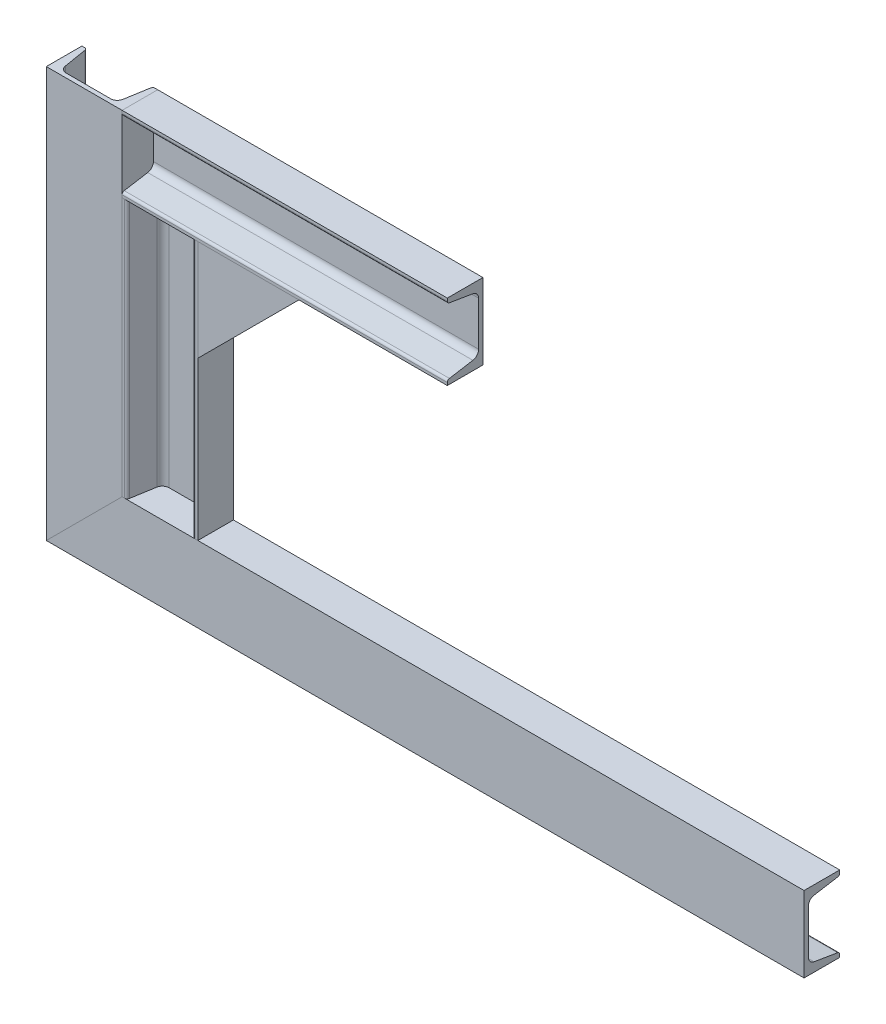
ISO-10303-21;
HEADER;
FILE_DESCRIPTION(('STEP AP214'),'2;1');
FILE_NAME('part.step','',(''),(''),'','','');
FILE_SCHEMA(('AUTOMOTIVE_DESIGN { 1 0 10303 214 1 1 1 1 }'));
ENDSEC;
DATA;
#1=APPLICATION_CONTEXT('core data for automotive mechanical design processes');
#2=APPLICATION_PROTOCOL_DEFINITION('international standard','automotive_design',2000,#1);
#3=PRODUCT_CONTEXT('',#1,'mechanical');
#4=PRODUCT('Part','Part','',(#3));
#5=PRODUCT_RELATED_PRODUCT_CATEGORY('part','',(#4));
#6=PRODUCT_DEFINITION_FORMATION('','',#4);
#7=PRODUCT_DEFINITION_CONTEXT('part definition',#1,'design');
#8=PRODUCT_DEFINITION('design','',#6,#7);
#9=PRODUCT_DEFINITION_SHAPE('','',#8);
#10=(LENGTH_UNIT() NAMED_UNIT(*) SI_UNIT(.MILLI.,.METRE.));
#11=(NAMED_UNIT(*) PLANE_ANGLE_UNIT() SI_UNIT($,.RADIAN.));
#12=(NAMED_UNIT(*) SI_UNIT($,.STERADIAN.) SOLID_ANGLE_UNIT());
#13=UNCERTAINTY_MEASURE_WITH_UNIT(LENGTH_MEASURE(1.E-05),#10,'distance_accuracy_value','');
#14=(GEOMETRIC_REPRESENTATION_CONTEXT(3) GLOBAL_UNCERTAINTY_ASSIGNED_CONTEXT((#13)) GLOBAL_UNIT_ASSIGNED_CONTEXT((#10,
#11,#12)) REPRESENTATION_CONTEXT('',''));
#15=CARTESIAN_POINT('',(0.,0.,0.));
#16=DIRECTION('',(0.,0.,1.));
#17=DIRECTION('',(1.,0.,0.));
#18=AXIS2_PLACEMENT_3D('',#15,#16,#17);
#19=CARTESIAN_POINT('',(43.3929284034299,-13.0741112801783,6.35));
#20=DIRECTION('',(0.,-1.,0.));
#21=DIRECTION('',(1.,0.,0.));
#22=AXIS2_PLACEMENT_3D('',#19,#20,#21);
#23=PLANE('',#22);
#24=DIRECTION('',(-1.,0.,0.));
#25=VECTOR('',#24,1.);
#26=CARTESIAN_POINT('',(43.3929284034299,-13.0741112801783,0.));
#27=LINE('',#26,#25);
#28=CARTESIAN_POINT('',(144.99292840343,-13.0741112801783,0.));
#29=VERTEX_POINT('',#28);
#30=CARTESIAN_POINT('',(43.3929284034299,-13.0741112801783,0.));
#31=VERTEX_POINT('',#30);
#32=EDGE_CURVE('E109',#29,#31,#27,.T.);
#33=ORIENTED_EDGE('',*,*,#32,.T.);
#34=DIRECTION('',(0.,0.,-1.));
#35=VECTOR('',#34,1.);
#36=CARTESIAN_POINT('',(43.3929284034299,-13.0741112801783,6.35));
#37=LINE('',#36,#35);
#38=CARTESIAN_POINT('',(43.3929284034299,-13.0741112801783,6.35));
#39=VERTEX_POINT('',#38);
#40=EDGE_CURVE('E13',#39,#31,#37,.T.);
#41=ORIENTED_EDGE('',*,*,#40,.F.);
#42=DIRECTION('',(-1.,0.,0.));
#43=VECTOR('',#42,1.);
#44=CARTESIAN_POINT('',(43.3929284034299,-13.0741112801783,6.35));
#45=LINE('',#44,#43);
#46=CARTESIAN_POINT('',(144.99292840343,-13.0741112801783,6.35));
#47=VERTEX_POINT('',#46);
#48=EDGE_CURVE('E102',#47,#39,#45,.T.);
#49=ORIENTED_EDGE('',*,*,#48,.F.);
#50=DIRECTION('',(0.,0.,-1.));
#51=VECTOR('',#50,1.);
#52=CARTESIAN_POINT('',(144.99292840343,-13.0741112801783,6.35));
#53=LINE('',#52,#51);
#54=EDGE_CURVE('E110',#47,#29,#53,.T.);
#55=ORIENTED_EDGE('',*,*,#54,.T.);
#56=EDGE_LOOP('',(#33,#41,#49,#55));
#57=FACE_BOUND('',#56,.T.);
#58=ADVANCED_FACE('F62',(#57),#23,.F.);
#59=CARTESIAN_POINT('',(43.3929284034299,-13.0741112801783,6.35));
#60=DIRECTION('',(1.,0.,0.));
#61=DIRECTION('',(0.,0.,-1.));
#62=AXIS2_PLACEMENT_3D('',#59,#60,#61);
#63=PLANE('',#62);
#64=DIRECTION('',(0.,-1.,0.));
#65=VECTOR('',#64,1.);
#66=CARTESIAN_POINT('',(43.3929284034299,-13.0741112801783,0.));
#67=LINE('',#66,#65);
#68=CARTESIAN_POINT('',(43.3929284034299,-114.674111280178,0.));
#69=VERTEX_POINT('',#68);
#70=EDGE_CURVE('E90',#31,#69,#67,.T.);
#71=ORIENTED_EDGE('',*,*,#70,.T.);
#72=DIRECTION('',(0.,0.,-1.));
#73=VECTOR('',#72,1.);
#74=CARTESIAN_POINT('',(43.3929284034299,-114.674111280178,6.35));
#75=LINE('',#74,#73);
#76=CARTESIAN_POINT('',(43.3929284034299,-114.674111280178,6.35));
#77=VERTEX_POINT('',#76);
#78=EDGE_CURVE('E70',#77,#69,#75,.T.);
#79=ORIENTED_EDGE('',*,*,#78,.F.);
#80=DIRECTION('',(0.,-1.,0.));
#81=VECTOR('',#80,1.);
#82=CARTESIAN_POINT('',(43.3929284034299,-13.0741112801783,6.35));
#83=LINE('',#82,#81);
#84=EDGE_CURVE('E98',#39,#77,#83,.T.);
#85=ORIENTED_EDGE('',*,*,#84,.F.);
#86=ORIENTED_EDGE('',*,*,#40,.T.);
#87=EDGE_LOOP('',(#71,#79,#85,#86));
#88=FACE_BOUND('',#87,.T.);
#89=ADVANCED_FACE('F99',(#88),#63,.F.);
#90=CARTESIAN_POINT('',(43.3929284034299,-114.674111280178,6.35));
#91=DIRECTION('',(-0.707106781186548,0.707106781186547,0.));
#92=DIRECTION('',(-0.707106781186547,-0.707106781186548,0.));
#93=AXIS2_PLACEMENT_3D('',#90,#91,#92);
#94=PLANE('',#93);
#95=DIRECTION('',(0.707106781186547,0.707106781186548,0.));
#96=VECTOR('',#95,1.);
#97=CARTESIAN_POINT('',(43.3929284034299,-114.674111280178,0.));
#98=LINE('',#97,#96);
#99=EDGE_CURVE('E95',#69,#29,#98,.T.);
#100=ORIENTED_EDGE('',*,*,#99,.T.);
#101=ORIENTED_EDGE('',*,*,#54,.F.);
#102=DIRECTION('',(0.707106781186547,0.707106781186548,0.));
#103=VECTOR('',#102,1.);
#104=CARTESIAN_POINT('',(43.3929284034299,-114.674111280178,6.35));
#105=LINE('',#104,#103);
#106=EDGE_CURVE('E78',#77,#47,#105,.T.);
#107=ORIENTED_EDGE('',*,*,#106,.F.);
#108=ORIENTED_EDGE('',*,*,#78,.T.);
#109=EDGE_LOOP('',(#100,#101,#107,#108));
#110=FACE_BOUND('',#109,.T.);
#111=ADVANCED_FACE('F117',(#110),#94,.F.);
#112=CARTESIAN_POINT('',(43.3929284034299,-13.0741112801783,6.35));
#113=DIRECTION('',(0.,0.,-1.));
#114=DIRECTION('',(-1.,0.,0.));
#115=AXIS2_PLACEMENT_3D('',#112,#113,#114);
#116=PLANE('',#115);
#117=ORIENTED_EDGE('',*,*,#48,.T.);
#118=ORIENTED_EDGE('',*,*,#84,.T.);
#119=ORIENTED_EDGE('',*,*,#106,.T.);
#120=EDGE_LOOP('',(#117,#118,#119));
#121=FACE_BOUND('',#120,.T.);
#122=ADVANCED_FACE('F105',(#121),#116,.F.);
#123=CARTESIAN_POINT('',(43.3929284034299,-13.0741112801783,0.));
#124=DIRECTION('',(0.,0.,-1.));
#125=DIRECTION('',(-1.,0.,0.));
#126=AXIS2_PLACEMENT_3D('',#123,#124,#125);
#127=PLANE('',#126);
#128=ORIENTED_EDGE('',*,*,#32,.F.);
#129=ORIENTED_EDGE('',*,*,#99,.F.);
#130=ORIENTED_EDGE('',*,*,#70,.F.);
#131=EDGE_LOOP('',(#128,#129,#130));
#132=FACE_BOUND('',#131,.T.);
#133=ADVANCED_FACE('F118',(#132),#127,.T.);
#134=CLOSED_SHELL('',(#58,#89,#111,#122,#133));
#135=MANIFOLD_SOLID_BREP('B2',#134);
#136=CARTESIAN_POINT('',(43.3929284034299,-13.0741112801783,29.464));
#137=DIRECTION('',(0.,-1.,0.));
#138=DIRECTION('',(0.,0.,-1.));
#139=AXIS2_PLACEMENT_3D('',#136,#137,#138);
#140=PLANE('',#139);
#141=DIRECTION('',(1.,0.,0.));
#142=VECTOR('',#141,1.);
#143=CARTESIAN_POINT('',(43.3929284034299,-13.0741112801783,35.814));
#144=LINE('',#143,#142);
#145=CARTESIAN_POINT('',(43.3929284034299,-13.0741112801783,35.814));
#146=VERTEX_POINT('',#145);
#147=CARTESIAN_POINT('',(144.99292840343,-13.0741112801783,35.8140000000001));
#148=VERTEX_POINT('',#147);
#149=EDGE_CURVE('E222',#146,#148,#144,.T.);
#150=ORIENTED_EDGE('',*,*,#149,.T.);
#151=DIRECTION('',(0.,0.,1.));
#152=VECTOR('',#151,1.);
#153=CARTESIAN_POINT('',(144.99292840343,-13.0741112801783,29.4640000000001));
#154=LINE('',#153,#152);
#155=CARTESIAN_POINT('',(144.99292840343,-13.0741112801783,29.4640000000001));
#156=VERTEX_POINT('',#155);
#157=EDGE_CURVE('E60',#156,#148,#154,.T.);
#158=ORIENTED_EDGE('',*,*,#157,.F.);
#159=DIRECTION('',(1.,0.,0.));
#160=VECTOR('',#159,1.);
#161=CARTESIAN_POINT('',(43.3929284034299,-13.0741112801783,29.464));
#162=LINE('',#161,#160);
#163=CARTESIAN_POINT('',(43.3929284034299,-13.0741112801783,29.464));
#164=VERTEX_POINT('',#163);
#165=EDGE_CURVE('E215',#164,#156,#162,.T.);
#166=ORIENTED_EDGE('',*,*,#165,.F.);
#167=DIRECTION('',(0.,0.,1.));
#168=VECTOR('',#167,1.);
#169=CARTESIAN_POINT('',(43.3929284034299,-13.0741112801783,29.464));
#170=LINE('',#169,#168);
#171=EDGE_CURVE('E223',#164,#146,#170,.T.);
#172=ORIENTED_EDGE('',*,*,#171,.T.);
#173=EDGE_LOOP('',(#150,#158,#166,#172));
#174=FACE_BOUND('',#173,.T.);
#175=ADVANCED_FACE('F175',(#174),#140,.F.);
#176=CARTESIAN_POINT('',(43.3929284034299,-114.674111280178,29.464));
#177=DIRECTION('',(-0.707106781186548,0.707106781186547,0.));
#178=DIRECTION('',(-0.707106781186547,-0.707106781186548,0.));
#179=AXIS2_PLACEMENT_3D('',#176,#177,#178);
#180=PLANE('',#179);
#181=DIRECTION('',(-0.707106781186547,-0.707106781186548,0.));
#182=VECTOR('',#181,1.);
#183=CARTESIAN_POINT('',(43.3929284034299,-114.674111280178,35.814));
#184=LINE('',#183,#182);
#185=CARTESIAN_POINT('',(43.3929284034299,-114.674111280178,35.814));
#186=VERTEX_POINT('',#185);
#187=EDGE_CURVE('E203',#148,#186,#184,.T.);
#188=ORIENTED_EDGE('',*,*,#187,.T.);
#189=DIRECTION('',(0.,0.,1.));
#190=VECTOR('',#189,1.);
#191=CARTESIAN_POINT('',(43.3929284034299,-114.674111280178,29.464));
#192=LINE('',#191,#190);
#193=CARTESIAN_POINT('',(43.3929284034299,-114.674111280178,29.464));
#194=VERTEX_POINT('',#193);
#195=EDGE_CURVE('E183',#194,#186,#192,.T.);
#196=ORIENTED_EDGE('',*,*,#195,.F.);
#197=DIRECTION('',(-0.707106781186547,-0.707106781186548,0.));
#198=VECTOR('',#197,1.);
#199=CARTESIAN_POINT('',(43.3929284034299,-114.674111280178,29.464));
#200=LINE('',#199,#198);
#201=EDGE_CURVE('E211',#156,#194,#200,.T.);
#202=ORIENTED_EDGE('',*,*,#201,.F.);
#203=ORIENTED_EDGE('',*,*,#157,.T.);
#204=EDGE_LOOP('',(#188,#196,#202,#203));
#205=FACE_BOUND('',#204,.T.);
#206=ADVANCED_FACE('F212',(#205),#180,.F.);
#207=CARTESIAN_POINT('',(43.3929284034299,-13.0741112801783,29.464));
#208=DIRECTION('',(1.,0.,0.));
#209=DIRECTION('',(0.,0.,-1.));
#210=AXIS2_PLACEMENT_3D('',#207,#208,#209);
#211=PLANE('',#210);
#212=DIRECTION('',(0.,1.,0.));
#213=VECTOR('',#212,1.);
#214=CARTESIAN_POINT('',(43.3929284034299,-13.0741112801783,35.814));
#215=LINE('',#214,#213);
#216=EDGE_CURVE('E208',#186,#146,#215,.T.);
#217=ORIENTED_EDGE('',*,*,#216,.T.);
#218=ORIENTED_EDGE('',*,*,#171,.F.);
#219=DIRECTION('',(0.,1.,0.));
#220=VECTOR('',#219,1.);
#221=CARTESIAN_POINT('',(43.3929284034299,-13.0741112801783,29.464));
#222=LINE('',#221,#220);
#223=EDGE_CURVE('E191',#194,#164,#222,.T.);
#224=ORIENTED_EDGE('',*,*,#223,.F.);
#225=ORIENTED_EDGE('',*,*,#195,.T.);
#226=EDGE_LOOP('',(#217,#218,#224,#225));
#227=FACE_BOUND('',#226,.T.);
#228=ADVANCED_FACE('F230',(#227),#211,.F.);
#229=CARTESIAN_POINT('',(43.3929284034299,-13.0741112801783,29.464));
#230=DIRECTION('',(0.,0.,-1.));
#231=DIRECTION('',(-1.,0.,0.));
#232=AXIS2_PLACEMENT_3D('',#229,#230,#231);
#233=PLANE('',#232);
#234=ORIENTED_EDGE('',*,*,#165,.T.);
#235=ORIENTED_EDGE('',*,*,#201,.T.);
#236=ORIENTED_EDGE('',*,*,#223,.T.);
#237=EDGE_LOOP('',(#234,#235,#236));
#238=FACE_BOUND('',#237,.T.);
#239=ADVANCED_FACE('F218',(#238),#233,.T.);
#240=CARTESIAN_POINT('',(43.3929284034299,-13.0741112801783,35.814));
#241=DIRECTION('',(0.,0.,-1.));
#242=DIRECTION('',(-1.,0.,0.));
#243=AXIS2_PLACEMENT_3D('',#240,#241,#242);
#244=PLANE('',#243);
#245=ORIENTED_EDGE('',*,*,#149,.F.);
#246=ORIENTED_EDGE('',*,*,#216,.F.);
#247=ORIENTED_EDGE('',*,*,#187,.F.);
#248=EDGE_LOOP('',(#245,#246,#247));
#249=FACE_BOUND('',#248,.T.);
#250=ADVANCED_FACE('F231',(#249),#244,.F.);
#251=CLOSED_SHELL('',(#175,#206,#228,#239,#250));
#252=MANIFOLD_SOLID_BREP('B7',#251);
#253=CARTESIAN_POINT('',(-109.00707159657,-273.424111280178,35.814));
#254=DIRECTION('',(1.,0.,0.));
#255=DIRECTION('',(0.,0.,-1.));
#256=AXIS2_PLACEMENT_3D('',#253,#254,#255);
#257=PLANE('',#256);
#258=DIRECTION('',(0.,0.,-1.));
#259=VECTOR('',#258,1.);
#260=CARTESIAN_POINT('',(-109.00707159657,-349.624111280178,35.814));
#261=LINE('',#260,#259);
#262=CARTESIAN_POINT('',(-109.00707159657,-349.624111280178,35.814));
#263=VERTEX_POINT('',#262);
#264=CARTESIAN_POINT('',(-109.00707159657,-349.624111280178,0.));
#265=VERTEX_POINT('',#264);
#266=EDGE_CURVE('E423',#263,#265,#261,.T.);
#267=ORIENTED_EDGE('',*,*,#266,.F.);
#268=DIRECTION('',(0.,1.,0.));
#269=VECTOR('',#268,1.);
#270=CARTESIAN_POINT('',(-109.00707159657,-273.424111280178,35.814));
#271=LINE('',#270,#269);
#272=CARTESIAN_POINT('',(-109.00707159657,63.1258887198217,35.814));
#273=VERTEX_POINT('',#272);
#274=EDGE_CURVE('E292',#263,#273,#271,.T.);
#275=ORIENTED_EDGE('',*,*,#274,.T.);
#276=DIRECTION('',(0.,0.,-1.));
#277=VECTOR('',#276,1.);
#278=CARTESIAN_POINT('',(-109.00707159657,63.1258887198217,35.814));
#279=LINE('',#278,#277);
#280=CARTESIAN_POINT('',(-109.00707159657,63.1258887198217,0.));
#281=VERTEX_POINT('',#280);
#282=EDGE_CURVE('E431',#273,#281,#279,.T.);
#283=ORIENTED_EDGE('',*,*,#282,.T.);
#284=DIRECTION('',(0.,1.,0.));
#285=VECTOR('',#284,1.);
#286=CARTESIAN_POINT('',(-109.00707159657,-273.424111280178,0.));
#287=LINE('',#286,#285);
#288=EDGE_CURVE('E359',#265,#281,#287,.T.);
#289=ORIENTED_EDGE('',*,*,#288,.F.);
#290=EDGE_LOOP('',(#267,#275,#283,#289));
#291=FACE_BOUND('',#290,.T.);
#292=ADVANCED_FACE('F288',(#291),#257,.F.);
#293=CARTESIAN_POINT('',(-109.00707159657,-273.424111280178,0.));
#294=DIRECTION('',(0.,0.,1.));
#295=DIRECTION('',(1.,0.,0.));
#296=AXIS2_PLACEMENT_3D('',#293,#294,#295);
#297=PLANE('',#296);
#298=DIRECTION('',(0.707106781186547,0.707106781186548,0.));
#299=VECTOR('',#298,1.);
#300=CARTESIAN_POINT('',(-70.90707159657,-311.524111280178,0.));
#301=LINE('',#300,#299);
#302=CARTESIAN_POINT('',(-106.342992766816,-346.960032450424,0.));
#303=VERTEX_POINT('',#302);
#304=EDGE_CURVE('E366',#265,#303,#301,.T.);
#305=ORIENTED_EDGE('',*,*,#304,.F.);
#306=ORIENTED_EDGE('',*,*,#288,.T.);
#307=DIRECTION('',(1.,0.,0.));
#308=VECTOR('',#307,1.);
#309=CARTESIAN_POINT('',(-109.00707159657,63.1258887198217,0.));
#310=LINE('',#309,#308);
#311=CARTESIAN_POINT('',(-106.342992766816,63.1258887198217,0.));
#312=VERTEX_POINT('',#311);
#313=EDGE_CURVE('E430',#281,#312,#310,.T.);
#314=ORIENTED_EDGE('',*,*,#313,.T.);
#315=DIRECTION('',(0.,1.,0.));
#316=VECTOR('',#315,1.);
#317=CARTESIAN_POINT('',(-106.342992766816,-273.424111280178,0.));
#318=LINE('',#317,#316);
#319=EDGE_CURVE('E432',#303,#312,#318,.T.);
#320=ORIENTED_EDGE('',*,*,#319,.F.);
#321=EDGE_LOOP('',(#305,#306,#314,#320));
#322=FACE_BOUND('',#321,.T.);
#323=ADVANCED_FACE('F481',(#322),#297,.F.);
#324=CARTESIAN_POINT('',(-106.342992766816,-273.424111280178,2.54));
#325=DIRECTION('',(0.,1.,0.));
#326=DIRECTION('',(0.,0.,1.));
#327=AXIS2_PLACEMENT_3D('',#324,#325,#326);
#328=CYLINDRICAL_SURFACE('',#327,2.54);
#329=CARTESIAN_POINT('',(-106.342992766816,-346.960032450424,2.54));
#330=DIRECTION('',(0.707106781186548,-0.707106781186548,0.));
#331=DIRECTION('',(0.707106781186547,0.707106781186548,0.));
#332=AXIS2_PLACEMENT_3D('',#329,#330,#331);
#333=ELLIPSE('',#332,3.59210244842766,2.54);
#334=CARTESIAN_POINT('',(-103.837557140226,-344.454596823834,2.12239693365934));
#335=VERTEX_POINT('',#334);
#336=EDGE_CURVE('E419',#303,#335,#333,.T.);
#337=ORIENTED_EDGE('',*,*,#336,.F.);
#338=ORIENTED_EDGE('',*,*,#319,.T.);
#339=CARTESIAN_POINT('',(-106.342992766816,63.1258887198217,2.54));
#340=DIRECTION('',(0.,-1.,0.));
#341=DIRECTION('',(1.,0.,0.));
#342=AXIS2_PLACEMENT_3D('',#339,#340,#341);
#343=CIRCLE('',#342,2.54);
#344=CARTESIAN_POINT('',(-103.837557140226,63.1258887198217,2.12239693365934));
#345=VERTEX_POINT('',#344);
#346=EDGE_CURVE('E434',#312,#345,#343,.T.);
#347=ORIENTED_EDGE('',*,*,#346,.T.);
#348=DIRECTION('',(0.,1.,0.));
#349=VECTOR('',#348,1.);
#350=CARTESIAN_POINT('',(-103.837557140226,-273.424111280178,2.12239693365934));
#351=LINE('',#350,#349);
#352=EDGE_CURVE('E435',#335,#345,#351,.T.);
#353=ORIENTED_EDGE('',*,*,#352,.F.);
#354=EDGE_LOOP('',(#337,#338,#347,#353));
#355=FACE_BOUND('',#354,.T.);
#356=ADVANCED_FACE('F484',(#355),#328,.T.);
#357=CARTESIAN_POINT('',(-99.8967477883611,-273.424111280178,25.7655282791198));
#358=DIRECTION('',(-0.986391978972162,0.,0.16441065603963));
#359=DIRECTION('',(0.16441065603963,0.,0.986391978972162));
#360=AXIS2_PLACEMENT_3D('',#357,#358,#359);
#361=PLANE('',#360);
#362=DIRECTION('',(0.162232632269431,0.162232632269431,0.973324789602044));
#363=VECTOR('',#362,1.);
#364=CARTESIAN_POINT('',(-98.1309859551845,-338.748025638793,36.3593264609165));
#365=LINE('',#364,#363);
#366=CARTESIAN_POINT('',(-99.8967477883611,-340.513787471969,25.7655282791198));
#367=VERTEX_POINT('',#366);
#368=EDGE_CURVE('E416',#335,#367,#365,.T.);
#369=ORIENTED_EDGE('',*,*,#368,.F.);
#370=ORIENTED_EDGE('',*,*,#352,.T.);
#371=DIRECTION('',(0.16441065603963,0.,0.986391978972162));
#372=VECTOR('',#371,1.);
#373=CARTESIAN_POINT('',(-99.8967477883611,63.1258887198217,25.7655282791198));
#374=LINE('',#373,#372);
#375=CARTESIAN_POINT('',(-99.8967477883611,63.1258887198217,25.7655282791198));
#376=VERTEX_POINT('',#375);
#377=EDGE_CURVE('E437',#345,#376,#374,.T.);
#378=ORIENTED_EDGE('',*,*,#377,.T.);
#379=DIRECTION('',(0.,1.,0.));
#380=VECTOR('',#379,1.);
#381=CARTESIAN_POINT('',(-99.8967477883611,-273.424111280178,25.7655282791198));
#382=LINE('',#381,#380);
#383=EDGE_CURVE('E438',#367,#376,#382,.T.);
#384=ORIENTED_EDGE('',*,*,#383,.F.);
#385=EDGE_LOOP('',(#369,#370,#378,#384));
#386=FACE_BOUND('',#385,.T.);
#387=ADVANCED_FACE('F486',(#386),#361,.F.);
#388=CARTESIAN_POINT('',(-93.1320715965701,-273.424111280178,24.638));
#389=DIRECTION('',(0.,1.,0.));
#390=DIRECTION('',(0.,0.,1.));
#391=AXIS2_PLACEMENT_3D('',#388,#389,#390);
#392=CYLINDRICAL_SURFACE('',#391,6.858);
#393=CARTESIAN_POINT('',(-93.1320715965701,-333.749111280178,24.638));
#394=DIRECTION('',(0.707106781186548,-0.707106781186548,0.));
#395=DIRECTION('',(0.707106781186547,0.707106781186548,0.));
#396=AXIS2_PLACEMENT_3D('',#393,#394,#395);
#397=ELLIPSE('',#396,9.69867661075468,6.858);
#398=CARTESIAN_POINT('',(-93.13207159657,-333.749111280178,31.496));
#399=VERTEX_POINT('',#398);
#400=EDGE_CURVE('E413',#367,#399,#397,.F.);
#401=ORIENTED_EDGE('',*,*,#400,.F.);
#402=ORIENTED_EDGE('',*,*,#383,.T.);
#403=CARTESIAN_POINT('',(-93.1320715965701,63.1258887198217,24.638));
#404=DIRECTION('',(0.,1.,0.));
#405=DIRECTION('',(1.,0.,0.));
#406=AXIS2_PLACEMENT_3D('',#403,#404,#405);
#407=CIRCLE('',#406,6.858);
#408=CARTESIAN_POINT('',(-93.1320715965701,63.1258887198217,31.496));
#409=VERTEX_POINT('',#408);
#410=EDGE_CURVE('E440',#376,#409,#407,.T.);
#411=ORIENTED_EDGE('',*,*,#410,.T.);
#412=DIRECTION('',(0.,1.,0.));
#413=VECTOR('',#412,1.);
#414=CARTESIAN_POINT('',(-93.1320715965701,-273.424111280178,31.496));
#415=LINE('',#414,#413);
#416=EDGE_CURVE('E441',#399,#409,#415,.T.);
#417=ORIENTED_EDGE('',*,*,#416,.F.);
#418=EDGE_LOOP('',(#401,#402,#411,#417));
#419=FACE_BOUND('',#418,.T.);
#420=ADVANCED_FACE('F490',(#419),#392,.F.);
#421=CARTESIAN_POINT('',(-48.6820715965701,-273.424111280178,31.496));
#422=DIRECTION('',(0.,0.,1.));
#423=DIRECTION('',(1.,0.,0.));
#424=AXIS2_PLACEMENT_3D('',#421,#422,#423);
#425=PLANE('',#424);
#426=DIRECTION('',(0.707106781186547,0.707106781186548,0.));
#427=VECTOR('',#426,1.);
#428=CARTESIAN_POINT('',(-40.7445715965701,-281.361611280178,31.496));
#429=LINE('',#428,#427);
#430=CARTESIAN_POINT('',(-48.6820715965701,-289.299111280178,31.496));
#431=VERTEX_POINT('',#430);
#432=EDGE_CURVE('E410',#399,#431,#429,.T.);
#433=ORIENTED_EDGE('',*,*,#432,.F.);
#434=ORIENTED_EDGE('',*,*,#416,.T.);
#435=DIRECTION('',(1.,0.,0.));
#436=VECTOR('',#435,1.);
#437=CARTESIAN_POINT('',(-48.6820715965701,63.1258887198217,31.496));
#438=LINE('',#437,#436);
#439=CARTESIAN_POINT('',(-48.6820715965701,63.1258887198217,31.496));
#440=VERTEX_POINT('',#439);
#441=EDGE_CURVE('E443',#409,#440,#438,.T.);
#442=ORIENTED_EDGE('',*,*,#441,.T.);
#443=DIRECTION('',(0.,1.,0.));
#444=VECTOR('',#443,1.);
#445=CARTESIAN_POINT('',(-48.6820715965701,-273.424111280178,31.496));
#446=LINE('',#445,#444);
#447=EDGE_CURVE('E444',#431,#440,#446,.T.);
#448=ORIENTED_EDGE('',*,*,#447,.F.);
#449=EDGE_LOOP('',(#433,#434,#442,#448));
#450=FACE_BOUND('',#449,.T.);
#451=ADVANCED_FACE('F495',(#450),#425,.F.);
#452=CARTESIAN_POINT('',(-48.6820715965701,-273.424111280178,24.638));
#453=DIRECTION('',(0.,1.,0.));
#454=DIRECTION('',(0.,0.,1.));
#455=AXIS2_PLACEMENT_3D('',#452,#453,#454);
#456=CYLINDRICAL_SURFACE('',#455,6.858);
#457=CARTESIAN_POINT('',(-48.6820715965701,-289.299111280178,24.638));
#458=DIRECTION('',(0.707106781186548,-0.707106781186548,0.));
#459=DIRECTION('',(0.707106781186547,0.707106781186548,0.));
#460=AXIS2_PLACEMENT_3D('',#457,#458,#459);
#461=ELLIPSE('',#460,9.69867661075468,6.858);
#462=CARTESIAN_POINT('',(-41.917395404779,-282.534435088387,25.7655282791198));
#463=VERTEX_POINT('',#462);
#464=EDGE_CURVE('E407',#431,#463,#461,.F.);
#465=ORIENTED_EDGE('',*,*,#464,.F.);
#466=ORIENTED_EDGE('',*,*,#447,.T.);
#467=CARTESIAN_POINT('',(-48.6820715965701,63.1258887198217,24.638));
#468=DIRECTION('',(0.,1.,0.));
#469=DIRECTION('',(-1.,0.,0.));
#470=AXIS2_PLACEMENT_3D('',#467,#468,#469);
#471=CIRCLE('',#470,6.858);
#472=CARTESIAN_POINT('',(-41.917395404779,63.1258887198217,25.7655282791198));
#473=VERTEX_POINT('',#472);
#474=EDGE_CURVE('E446',#440,#473,#471,.T.);
#475=ORIENTED_EDGE('',*,*,#474,.T.);
#476=DIRECTION('',(0.,1.,0.));
#477=VECTOR('',#476,1.);
#478=CARTESIAN_POINT('',(-41.917395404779,-273.424111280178,25.7655282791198));
#479=LINE('',#478,#477);
#480=EDGE_CURVE('E447',#463,#473,#479,.T.);
#481=ORIENTED_EDGE('',*,*,#480,.F.);
#482=EDGE_LOOP('',(#465,#466,#475,#481));
#483=FACE_BOUND('',#482,.T.);
#484=ADVANCED_FACE('F498',(#483),#456,.F.);
#485=CARTESIAN_POINT('',(-41.917395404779,-273.424111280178,25.7655282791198));
#486=DIRECTION('',(0.986391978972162,0.,0.16441065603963));
#487=DIRECTION('',(0.16441065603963,0.,-0.986391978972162));
#488=AXIS2_PLACEMENT_3D('',#485,#486,#487);
#489=PLANE('',#488);
#490=DIRECTION('',(0.162232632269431,0.162232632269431,-0.973324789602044));
#491=VECTOR('',#490,1.);
#492=CARTESIAN_POINT('',(-41.6776169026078,-282.294656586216,24.3269622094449));
#493=LINE('',#492,#491);
#494=CARTESIAN_POINT('',(-37.9765860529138,-278.593625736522,2.12239693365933));
#495=VERTEX_POINT('',#494);
#496=EDGE_CURVE('E402',#463,#495,#493,.T.);
#497=ORIENTED_EDGE('',*,*,#496,.F.);
#498=ORIENTED_EDGE('',*,*,#480,.T.);
#499=DIRECTION('',(0.16441065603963,0.,-0.986391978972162));
#500=VECTOR('',#499,1.);
#501=CARTESIAN_POINT('',(-41.917395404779,63.1258887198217,25.7655282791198));
#502=LINE('',#501,#500);
#503=CARTESIAN_POINT('',(-37.9765860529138,63.1258887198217,2.12239693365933));
#504=VERTEX_POINT('',#503);
#505=EDGE_CURVE('E449',#473,#504,#502,.T.);
#506=ORIENTED_EDGE('',*,*,#505,.T.);
#507=DIRECTION('',(0.,1.,0.));
#508=VECTOR('',#507,1.);
#509=CARTESIAN_POINT('',(-37.9765860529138,-273.424111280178,2.12239693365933));
#510=LINE('',#509,#508);
#511=EDGE_CURVE('E450',#495,#504,#510,.T.);
#512=ORIENTED_EDGE('',*,*,#511,.F.);
#513=EDGE_LOOP('',(#497,#498,#506,#512));
#514=FACE_BOUND('',#513,.T.);
#515=ADVANCED_FACE('F502',(#514),#489,.F.);
#516=CARTESIAN_POINT('',(-35.4711504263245,-273.424111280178,2.54));
#517=DIRECTION('',(0.,1.,0.));
#518=DIRECTION('',(0.,0.,1.));
#519=AXIS2_PLACEMENT_3D('',#516,#517,#518);
#520=CYLINDRICAL_SURFACE('',#519,2.54);
#521=CARTESIAN_POINT('',(-35.4711504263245,-276.088190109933,2.54));
#522=DIRECTION('',(0.707106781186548,-0.707106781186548,0.));
#523=DIRECTION('',(0.707106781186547,0.707106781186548,0.));
#524=AXIS2_PLACEMENT_3D('',#521,#522,#523);
#525=ELLIPSE('',#524,3.59210244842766,2.54);
#526=CARTESIAN_POINT('',(-35.4711504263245,-276.088190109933,0.));
#527=VERTEX_POINT('',#526);
#528=EDGE_CURVE('E400',#495,#527,#525,.T.);
#529=ORIENTED_EDGE('',*,*,#528,.F.);
#530=ORIENTED_EDGE('',*,*,#511,.T.);
#531=CARTESIAN_POINT('',(-35.4711504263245,63.1258887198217,2.54));
#532=DIRECTION('',(0.,-1.,0.));
#533=DIRECTION('',(-1.,0.,0.));
#534=AXIS2_PLACEMENT_3D('',#531,#532,#533);
#535=CIRCLE('',#534,2.54);
#536=CARTESIAN_POINT('',(-35.4711504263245,63.1258887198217,0.));
#537=VERTEX_POINT('',#536);
#538=EDGE_CURVE('E452',#504,#537,#535,.T.);
#539=ORIENTED_EDGE('',*,*,#538,.T.);
#540=DIRECTION('',(0.,1.,0.));
#541=VECTOR('',#540,1.);
#542=CARTESIAN_POINT('',(-35.4711504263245,-273.424111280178,0.));
#543=LINE('',#542,#541);
#544=EDGE_CURVE('E453',#527,#537,#543,.T.);
#545=ORIENTED_EDGE('',*,*,#544,.F.);
#546=EDGE_LOOP('',(#529,#530,#539,#545));
#547=FACE_BOUND('',#546,.T.);
#548=ADVANCED_FACE('F506',(#547),#520,.T.);
#549=CARTESIAN_POINT('',(-32.8070715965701,-273.424111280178,0.));
#550=DIRECTION('',(0.,0.,1.));
#551=DIRECTION('',(1.,0.,0.));
#552=AXIS2_PLACEMENT_3D('',#549,#550,#551);
#553=PLANE('',#552);
#554=DIRECTION('',(0.707106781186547,0.707106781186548,0.));
#555=VECTOR('',#554,1.);
#556=CARTESIAN_POINT('',(-32.8070715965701,-273.424111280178,0.));
#557=LINE('',#556,#555);
#558=CARTESIAN_POINT('',(-32.8070715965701,-273.424111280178,0.));
#559=VERTEX_POINT('',#558);
#560=EDGE_CURVE('E297',#527,#559,#557,.T.);
#561=ORIENTED_EDGE('',*,*,#560,.F.);
#562=ORIENTED_EDGE('',*,*,#544,.T.);
#563=DIRECTION('',(1.,0.,0.));
#564=VECTOR('',#563,1.);
#565=CARTESIAN_POINT('',(-32.8070715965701,63.1258887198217,0.));
#566=LINE('',#565,#564);
#567=CARTESIAN_POINT('',(-32.8070715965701,63.1258887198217,0.));
#568=VERTEX_POINT('',#567);
#569=EDGE_CURVE('E394',#537,#568,#566,.T.);
#570=ORIENTED_EDGE('',*,*,#569,.T.);
#571=DIRECTION('',(0.,1.,0.));
#572=VECTOR('',#571,1.);
#573=CARTESIAN_POINT('',(-32.8070715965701,-273.424111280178,0.));
#574=LINE('',#573,#572);
#575=EDGE_CURVE('E385',#559,#568,#574,.T.);
#576=ORIENTED_EDGE('',*,*,#575,.F.);
#577=EDGE_LOOP('',(#561,#562,#570,#576));
#578=FACE_BOUND('',#577,.T.);
#579=ADVANCED_FACE('F391',(#578),#553,.F.);
#580=CARTESIAN_POINT('',(-32.8070715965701,-273.424111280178,35.814));
#581=DIRECTION('',(-1.,0.,0.));
#582=DIRECTION('',(0.,0.,1.));
#583=AXIS2_PLACEMENT_3D('',#580,#581,#582);
#584=PLANE('',#583);
#585=DIRECTION('',(0.,0.,1.));
#586=VECTOR('',#585,1.);
#587=CARTESIAN_POINT('',(-32.8070715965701,-273.424111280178,35.814));
#588=LINE('',#587,#586);
#589=CARTESIAN_POINT('',(-32.8070715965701,-273.424111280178,35.814));
#590=VERTEX_POINT('',#589);
#591=EDGE_CURVE('E173',#559,#590,#588,.T.);
#592=ORIENTED_EDGE('',*,*,#591,.F.);
#593=ORIENTED_EDGE('',*,*,#575,.T.);
#594=DIRECTION('',(0.,0.,1.));
#595=VECTOR('',#594,1.);
#596=CARTESIAN_POINT('',(-32.8070715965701,63.1258887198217,35.814));
#597=LINE('',#596,#595);
#598=CARTESIAN_POINT('',(-32.8070715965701,63.1258887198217,35.814));
#599=VERTEX_POINT('',#598);
#600=EDGE_CURVE('E396',#568,#599,#597,.T.);
#601=ORIENTED_EDGE('',*,*,#600,.T.);
#602=DIRECTION('',(0.,1.,0.));
#603=VECTOR('',#602,1.);
#604=CARTESIAN_POINT('',(-32.8070715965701,-273.424111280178,35.814));
#605=LINE('',#604,#603);
#606=EDGE_CURVE('E310',#590,#599,#605,.T.);
#607=ORIENTED_EDGE('',*,*,#606,.F.);
#608=EDGE_LOOP('',(#592,#593,#601,#607));
#609=FACE_BOUND('',#608,.T.);
#610=ADVANCED_FACE('F384',(#609),#584,.F.);
#611=CARTESIAN_POINT('',(-109.00707159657,-273.424111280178,35.814));
#612=DIRECTION('',(0.,0.,-1.));
#613=DIRECTION('',(-1.,0.,0.));
#614=AXIS2_PLACEMENT_3D('',#611,#612,#613);
#615=PLANE('',#614);
#616=DIRECTION('',(-0.707106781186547,-0.707106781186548,0.));
#617=VECTOR('',#616,1.);
#618=CARTESIAN_POINT('',(-70.90707159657,-311.524111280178,35.814));
#619=LINE('',#618,#617);
#620=EDGE_CURVE('E426',#590,#263,#619,.T.);
#621=ORIENTED_EDGE('',*,*,#620,.F.);
#622=ORIENTED_EDGE('',*,*,#606,.T.);
#623=DIRECTION('',(-1.,0.,0.));
#624=VECTOR('',#623,1.);
#625=CARTESIAN_POINT('',(-109.00707159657,63.1258887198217,35.814));
#626=LINE('',#625,#624);
#627=EDGE_CURVE('E428',#599,#273,#626,.T.);
#628=ORIENTED_EDGE('',*,*,#627,.T.);
#629=ORIENTED_EDGE('',*,*,#274,.F.);
#630=EDGE_LOOP('',(#621,#622,#628,#629));
#631=FACE_BOUND('',#630,.T.);
#632=ADVANCED_FACE('F476',(#631),#615,.F.);
#633=CARTESIAN_POINT('',(-106.342992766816,63.1258887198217,2.54));
#634=DIRECTION('',(0.,-1.,0.));
#635=DIRECTION('',(1.,0.,0.));
#636=AXIS2_PLACEMENT_3D('',#633,#634,#635);
#637=PLANE('',#636);
#638=ORIENTED_EDGE('',*,*,#282,.F.);
#639=ORIENTED_EDGE('',*,*,#627,.F.);
#640=ORIENTED_EDGE('',*,*,#600,.F.);
#641=ORIENTED_EDGE('',*,*,#569,.F.);
#642=ORIENTED_EDGE('',*,*,#538,.F.);
#643=ORIENTED_EDGE('',*,*,#505,.F.);
#644=ORIENTED_EDGE('',*,*,#474,.F.);
#645=ORIENTED_EDGE('',*,*,#441,.F.);
#646=ORIENTED_EDGE('',*,*,#410,.F.);
#647=ORIENTED_EDGE('',*,*,#377,.F.);
#648=ORIENTED_EDGE('',*,*,#346,.F.);
#649=ORIENTED_EDGE('',*,*,#313,.F.);
#650=EDGE_LOOP('',(#638,#639,#640,#641,#642,#643,#644,#645,#646,#647,#648,#649));
#651=FACE_BOUND('',#650,.T.);
#652=ADVANCED_FACE('F478',(#651),#637,.F.);
#653=CARTESIAN_POINT('',(-32.8070715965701,-273.424111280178,0.));
#654=DIRECTION('',(0.707106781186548,-0.707106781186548,0.));
#655=DIRECTION('',(0.707106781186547,0.707106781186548,0.));
#656=AXIS2_PLACEMENT_3D('',#653,#654,#655);
#657=PLANE('',#656);
#658=ORIENTED_EDGE('',*,*,#620,.T.);
#659=ORIENTED_EDGE('',*,*,#266,.T.);
#660=ORIENTED_EDGE('',*,*,#304,.T.);
#661=ORIENTED_EDGE('',*,*,#336,.T.);
#662=ORIENTED_EDGE('',*,*,#368,.T.);
#663=ORIENTED_EDGE('',*,*,#400,.T.);
#664=ORIENTED_EDGE('',*,*,#432,.T.);
#665=ORIENTED_EDGE('',*,*,#464,.T.);
#666=ORIENTED_EDGE('',*,*,#496,.T.);
#667=ORIENTED_EDGE('',*,*,#528,.T.);
#668=ORIENTED_EDGE('',*,*,#560,.T.);
#669=ORIENTED_EDGE('',*,*,#591,.T.);
#670=EDGE_LOOP('',(#658,#659,#660,#661,#662,#663,#664,#665,#666,#667,#668,#669));
#671=FACE_BOUND('',#670,.T.);
#672=ADVANCED_FACE('F290',(#671),#657,.T.);
#673=CLOSED_SHELL('',(#292,#323,#356,#387,#420,#451,#484,#515,#548,#579,#610,#632,#652,#672));
#674=MANIFOLD_SOLID_BREP('B54',#673);
#675=CARTESIAN_POINT('',(652.99292840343,-346.960032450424,2.54));
#676=DIRECTION('',(1.,0.,0.));
#677=DIRECTION('',(0.,1.,0.));
#678=AXIS2_PLACEMENT_3D('',#675,#676,#677);
#679=PLANE('',#678);
#680=DIRECTION('',(0.,0.,-1.));
#681=VECTOR('',#680,1.);
#682=CARTESIAN_POINT('',(652.99292840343,-349.624111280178,35.814));
#683=LINE('',#682,#681);
#684=CARTESIAN_POINT('',(652.99292840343,-349.624111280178,35.814));
#685=VERTEX_POINT('',#684);
#686=CARTESIAN_POINT('',(652.99292840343,-349.624111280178,0.));
#687=VERTEX_POINT('',#686);
#688=EDGE_CURVE('E770',#685,#687,#683,.T.);
#689=ORIENTED_EDGE('',*,*,#688,.T.);
#690=DIRECTION('',(0.,1.,0.));
#691=VECTOR('',#690,1.);
#692=CARTESIAN_POINT('',(652.99292840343,-349.624111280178,0.));
#693=LINE('',#692,#691);
#694=CARTESIAN_POINT('',(652.99292840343,-346.960032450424,0.));
#695=VERTEX_POINT('',#694);
#696=EDGE_CURVE('E758',#687,#695,#693,.T.);
#697=ORIENTED_EDGE('',*,*,#696,.T.);
#698=CARTESIAN_POINT('',(652.99292840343,-346.960032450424,2.54));
#699=DIRECTION('',(1.,0.,0.));
#700=DIRECTION('',(0.,1.,0.));
#701=AXIS2_PLACEMENT_3D('',#698,#699,#700);
#702=CIRCLE('',#701,2.54);
#703=CARTESIAN_POINT('',(652.99292840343,-344.454596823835,2.12239693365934));
#704=VERTEX_POINT('',#703);
#705=EDGE_CURVE('E769',#695,#704,#702,.T.);
#706=ORIENTED_EDGE('',*,*,#705,.T.);
#707=DIRECTION('',(0.,0.16441065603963,0.986391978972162));
#708=VECTOR('',#707,1.);
#709=CARTESIAN_POINT('',(652.99292840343,-340.513787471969,25.7655282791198));
#710=LINE('',#709,#708);
#711=CARTESIAN_POINT('',(652.99292840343,-340.513787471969,25.7655282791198));
#712=VERTEX_POINT('',#711);
#713=EDGE_CURVE('E825',#704,#712,#710,.T.);
#714=ORIENTED_EDGE('',*,*,#713,.T.);
#715=CARTESIAN_POINT('',(652.99292840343,-333.749111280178,24.638));
#716=DIRECTION('',(-1.,0.,0.));
#717=DIRECTION('',(0.,1.,0.));
#718=AXIS2_PLACEMENT_3D('',#715,#716,#717);
#719=CIRCLE('',#718,6.858);
#720=CARTESIAN_POINT('',(652.99292840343,-333.749111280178,31.496));
#721=VERTEX_POINT('',#720);
#722=EDGE_CURVE('E823',#712,#721,#719,.T.);
#723=ORIENTED_EDGE('',*,*,#722,.T.);
#724=DIRECTION('',(0.,1.,0.));
#725=VECTOR('',#724,1.);
#726=CARTESIAN_POINT('',(652.99292840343,-289.299111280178,31.496));
#727=LINE('',#726,#725);
#728=CARTESIAN_POINT('',(652.99292840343,-289.299111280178,31.496));
#729=VERTEX_POINT('',#728);
#730=EDGE_CURVE('E821',#721,#729,#727,.T.);
#731=ORIENTED_EDGE('',*,*,#730,.T.);
#732=CARTESIAN_POINT('',(652.99292840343,-289.299111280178,24.638));
#733=DIRECTION('',(-1.,0.,0.));
#734=DIRECTION('',(0.,-1.,0.));
#735=AXIS2_PLACEMENT_3D('',#732,#733,#734);
#736=CIRCLE('',#735,6.858);
#737=CARTESIAN_POINT('',(652.99292840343,-282.534435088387,25.7655282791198));
#738=VERTEX_POINT('',#737);
#739=EDGE_CURVE('E819',#729,#738,#736,.T.);
#740=ORIENTED_EDGE('',*,*,#739,.T.);
#741=DIRECTION('',(0.,0.16441065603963,-0.986391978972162));
#742=VECTOR('',#741,1.);
#743=CARTESIAN_POINT('',(652.99292840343,-282.534435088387,25.7655282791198));
#744=LINE('',#743,#742);
#745=CARTESIAN_POINT('',(652.99292840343,-278.593625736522,2.12239693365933));
#746=VERTEX_POINT('',#745);
#747=EDGE_CURVE('E817',#738,#746,#744,.T.);
#748=ORIENTED_EDGE('',*,*,#747,.T.);
#749=CARTESIAN_POINT('',(652.99292840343,-276.088190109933,2.54));
#750=DIRECTION('',(1.,0.,0.));
#751=DIRECTION('',(0.,-1.,0.));
#752=AXIS2_PLACEMENT_3D('',#749,#750,#751);
#753=CIRCLE('',#752,2.54);
#754=CARTESIAN_POINT('',(652.99292840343,-276.088190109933,0.));
#755=VERTEX_POINT('',#754);
#756=EDGE_CURVE('E815',#746,#755,#753,.T.);
#757=ORIENTED_EDGE('',*,*,#756,.T.);
#758=DIRECTION('',(0.,1.,0.));
#759=VECTOR('',#758,1.);
#760=CARTESIAN_POINT('',(652.99292840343,-273.424111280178,0.));
#761=LINE('',#760,#759);
#762=CARTESIAN_POINT('',(652.99292840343,-273.424111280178,0.));
#763=VERTEX_POINT('',#762);
#764=EDGE_CURVE('E813',#755,#763,#761,.T.);
#765=ORIENTED_EDGE('',*,*,#764,.T.);
#766=DIRECTION('',(0.,0.,1.));
#767=VECTOR('',#766,1.);
#768=CARTESIAN_POINT('',(652.99292840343,-273.424111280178,35.814));
#769=LINE('',#768,#767);
#770=CARTESIAN_POINT('',(652.99292840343,-273.424111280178,35.814));
#771=VERTEX_POINT('',#770);
#772=EDGE_CURVE('E811',#763,#771,#769,.T.);
#773=ORIENTED_EDGE('',*,*,#772,.T.);
#774=DIRECTION('',(0.,-1.,0.));
#775=VECTOR('',#774,1.);
#776=CARTESIAN_POINT('',(652.99292840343,-349.624111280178,35.814));
#777=LINE('',#776,#775);
#778=EDGE_CURVE('E774',#771,#685,#777,.T.);
#779=ORIENTED_EDGE('',*,*,#778,.T.);
#780=EDGE_LOOP('',(#689,#697,#706,#714,#723,#731,#740,#748,#757,#765,#773,#779));
#781=FACE_BOUND('',#780,.T.);
#782=ADVANCED_FACE('F672',(#781),#679,.T.);
#783=CARTESIAN_POINT('',(652.99292840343,-349.624111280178,35.814));
#784=DIRECTION('',(0.,0.,-1.));
#785=DIRECTION('',(-1.,0.,0.));
#786=AXIS2_PLACEMENT_3D('',#783,#784,#785);
#787=PLANE('',#786);
#788=DIRECTION('',(-1.,0.,0.));
#789=VECTOR('',#788,1.);
#790=CARTESIAN_POINT('',(652.99292840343,-273.424111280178,35.814));
#791=LINE('',#790,#789);
#792=CARTESIAN_POINT('',(-32.8070715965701,-273.424111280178,35.814));
#793=VERTEX_POINT('',#792);
#794=EDGE_CURVE('E805',#771,#793,#791,.T.);
#795=ORIENTED_EDGE('',*,*,#794,.T.);
#796=DIRECTION('',(-0.707106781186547,-0.707106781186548,0.));
#797=VECTOR('',#796,1.);
#798=CARTESIAN_POINT('',(271.99292840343,31.3758887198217,35.814));
#799=LINE('',#798,#797);
#800=CARTESIAN_POINT('',(-109.00707159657,-349.624111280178,35.814));
#801=VERTEX_POINT('',#800);
#802=EDGE_CURVE('E676',#793,#801,#799,.T.);
#803=ORIENTED_EDGE('',*,*,#802,.T.);
#804=DIRECTION('',(-1.,0.,0.));
#805=VECTOR('',#804,1.);
#806=CARTESIAN_POINT('',(652.99292840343,-349.624111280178,35.814));
#807=LINE('',#806,#805);
#808=EDGE_CURVE('E808',#685,#801,#807,.T.);
#809=ORIENTED_EDGE('',*,*,#808,.F.);
#810=ORIENTED_EDGE('',*,*,#778,.F.);
#811=EDGE_LOOP('',(#795,#803,#809,#810));
#812=FACE_BOUND('',#811,.T.);
#813=ADVANCED_FACE('F890',(#812),#787,.F.);
#814=CARTESIAN_POINT('',(652.99292840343,-273.424111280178,35.814));
#815=DIRECTION('',(0.,-1.,0.));
#816=DIRECTION('',(0.,0.,-1.));
#817=AXIS2_PLACEMENT_3D('',#814,#815,#816);
#818=PLANE('',#817);
#819=DIRECTION('',(-1.,0.,0.));
#820=VECTOR('',#819,1.);
#821=CARTESIAN_POINT('',(652.99292840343,-273.424111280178,0.));
#822=LINE('',#821,#820);
#823=CARTESIAN_POINT('',(-32.80707159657,-273.424111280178,0.));
#824=VERTEX_POINT('',#823);
#825=EDGE_CURVE('E803',#763,#824,#822,.T.);
#826=ORIENTED_EDGE('',*,*,#825,.T.);
#827=DIRECTION('',(0.,0.,1.));
#828=VECTOR('',#827,1.);
#829=CARTESIAN_POINT('',(-32.80707159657,-273.424111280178,35.814));
#830=LINE('',#829,#828);
#831=EDGE_CURVE('E286',#824,#793,#830,.T.);
#832=ORIENTED_EDGE('',*,*,#831,.T.);
#833=ORIENTED_EDGE('',*,*,#794,.F.);
#834=ORIENTED_EDGE('',*,*,#772,.F.);
#835=EDGE_LOOP('',(#826,#832,#833,#834));
#836=FACE_BOUND('',#835,.T.);
#837=ADVANCED_FACE('F888',(#836),#818,.F.);
#838=CARTESIAN_POINT('',(652.99292840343,-273.424111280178,0.));
#839=DIRECTION('',(0.,0.,1.));
#840=DIRECTION('',(1.,0.,0.));
#841=AXIS2_PLACEMENT_3D('',#838,#839,#840);
#842=PLANE('',#841);
#843=DIRECTION('',(-1.,0.,0.));
#844=VECTOR('',#843,1.);
#845=CARTESIAN_POINT('',(652.99292840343,-276.088190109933,0.));
#846=LINE('',#845,#844);
#847=CARTESIAN_POINT('',(-35.4711504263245,-276.088190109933,0.));
#848=VERTEX_POINT('',#847);
#849=EDGE_CURVE('E800',#755,#848,#846,.T.);
#850=ORIENTED_EDGE('',*,*,#849,.T.);
#851=DIRECTION('',(0.707106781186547,0.707106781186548,0.));
#852=VECTOR('',#851,1.);
#853=CARTESIAN_POINT('',(310.09292840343,69.4758887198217,0.));
#854=LINE('',#853,#852);
#855=EDGE_CURVE('E681',#848,#824,#854,.T.);
#856=ORIENTED_EDGE('',*,*,#855,.T.);
#857=ORIENTED_EDGE('',*,*,#825,.F.);
#858=ORIENTED_EDGE('',*,*,#764,.F.);
#859=EDGE_LOOP('',(#850,#856,#857,#858));
#860=FACE_BOUND('',#859,.T.);
#861=ADVANCED_FACE('F855',(#860),#842,.F.);
#862=CARTESIAN_POINT('',(652.99292840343,-276.088190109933,2.54));
#863=DIRECTION('',(-1.,0.,0.));
#864=DIRECTION('',(0.,0.,1.));
#865=AXIS2_PLACEMENT_3D('',#862,#863,#864);
#866=CYLINDRICAL_SURFACE('',#865,2.54);
#867=DIRECTION('',(-1.,0.,0.));
#868=VECTOR('',#867,1.);
#869=CARTESIAN_POINT('',(652.99292840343,-278.593625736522,2.12239693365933));
#870=LINE('',#869,#868);
#871=CARTESIAN_POINT('',(-37.9765860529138,-278.593625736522,2.12239693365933));
#872=VERTEX_POINT('',#871);
#873=EDGE_CURVE('E797',#746,#872,#870,.T.);
#874=ORIENTED_EDGE('',*,*,#873,.T.);
#875=CARTESIAN_POINT('',(-35.4711504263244,-276.088190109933,2.54));
#876=DIRECTION('',(0.707106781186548,-0.707106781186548,0.));
#877=DIRECTION('',(-0.707106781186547,-0.707106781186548,0.));
#878=AXIS2_PLACEMENT_3D('',#875,#876,#877);
#879=ELLIPSE('',#878,3.59210244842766,2.54);
#880=EDGE_CURVE('E849',#872,#848,#879,.T.);
#881=ORIENTED_EDGE('',*,*,#880,.T.);
#882=ORIENTED_EDGE('',*,*,#849,.F.);
#883=ORIENTED_EDGE('',*,*,#756,.F.);
#884=EDGE_LOOP('',(#874,#881,#882,#883));
#885=FACE_BOUND('',#884,.T.);
#886=ADVANCED_FACE('F863',(#885),#866,.T.);
#887=CARTESIAN_POINT('',(652.99292840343,-282.534435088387,25.7655282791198));
#888=DIRECTION('',(0.,0.986391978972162,0.16441065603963));
#889=DIRECTION('',(0.,-0.16441065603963,0.986391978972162));
#890=AXIS2_PLACEMENT_3D('',#887,#888,#889);
#891=PLANE('',#890);
#892=DIRECTION('',(-1.,0.,0.));
#893=VECTOR('',#892,1.);
#894=CARTESIAN_POINT('',(652.99292840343,-282.534435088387,25.7655282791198));
#895=LINE('',#894,#893);
#896=CARTESIAN_POINT('',(-41.917395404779,-282.534435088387,25.7655282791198));
#897=VERTEX_POINT('',#896);
#898=EDGE_CURVE('E794',#738,#897,#895,.T.);
#899=ORIENTED_EDGE('',*,*,#898,.T.);
#900=DIRECTION('',(0.162232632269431,0.162232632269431,-0.973324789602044));
#901=VECTOR('',#900,1.);
#902=CARTESIAN_POINT('',(-23.6277538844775,-264.244793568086,-83.9643160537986));
#903=LINE('',#902,#901);
#904=EDGE_CURVE('E846',#897,#872,#903,.T.);
#905=ORIENTED_EDGE('',*,*,#904,.T.);
#906=ORIENTED_EDGE('',*,*,#873,.F.);
#907=ORIENTED_EDGE('',*,*,#747,.F.);
#908=EDGE_LOOP('',(#899,#905,#906,#907));
#909=FACE_BOUND('',#908,.T.);
#910=ADVANCED_FACE('F866',(#909),#891,.F.);
#911=CARTESIAN_POINT('',(652.99292840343,-289.299111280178,24.638));
#912=DIRECTION('',(-1.,0.,0.));
#913=DIRECTION('',(0.,0.,1.));
#914=AXIS2_PLACEMENT_3D('',#911,#912,#913);
#915=CYLINDRICAL_SURFACE('',#914,6.858);
#916=DIRECTION('',(-1.,0.,0.));
#917=VECTOR('',#916,1.);
#918=CARTESIAN_POINT('',(652.99292840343,-289.299111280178,31.496));
#919=LINE('',#918,#917);
#920=CARTESIAN_POINT('',(-48.68207159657,-289.299111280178,31.496));
#921=VERTEX_POINT('',#920);
#922=EDGE_CURVE('E791',#729,#921,#919,.T.);
#923=ORIENTED_EDGE('',*,*,#922,.T.);
#924=CARTESIAN_POINT('',(-48.68207159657,-289.299111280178,24.638));
#925=DIRECTION('',(0.707106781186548,-0.707106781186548,0.));
#926=DIRECTION('',(-0.707106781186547,-0.707106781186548,0.));
#927=AXIS2_PLACEMENT_3D('',#924,#925,#926);
#928=ELLIPSE('',#927,9.69867661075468,6.858);
#929=EDGE_CURVE('E843',#921,#897,#928,.F.);
#930=ORIENTED_EDGE('',*,*,#929,.T.);
#931=ORIENTED_EDGE('',*,*,#898,.F.);
#932=ORIENTED_EDGE('',*,*,#739,.F.);
#933=EDGE_LOOP('',(#923,#930,#931,#932));
#934=FACE_BOUND('',#933,.T.);
#935=ADVANCED_FACE('F870',(#934),#915,.F.);
#936=CARTESIAN_POINT('',(652.99292840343,-289.299111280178,31.496));
#937=DIRECTION('',(0.,0.,1.));
#938=DIRECTION('',(1.,0.,0.));
#939=AXIS2_PLACEMENT_3D('',#936,#937,#938);
#940=PLANE('',#939);
#941=DIRECTION('',(-1.,0.,0.));
#942=VECTOR('',#941,1.);
#943=CARTESIAN_POINT('',(652.99292840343,-333.749111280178,31.496));
#944=LINE('',#943,#942);
#945=CARTESIAN_POINT('',(-93.1320715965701,-333.749111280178,31.496));
#946=VERTEX_POINT('',#945);
#947=EDGE_CURVE('E788',#721,#946,#944,.T.);
#948=ORIENTED_EDGE('',*,*,#947,.T.);
#949=DIRECTION('',(0.707106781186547,0.707106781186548,0.));
#950=VECTOR('',#949,1.);
#951=CARTESIAN_POINT('',(302.15542840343,61.5383887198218,31.496));
#952=LINE('',#951,#950);
#953=EDGE_CURVE('E840',#946,#921,#952,.T.);
#954=ORIENTED_EDGE('',*,*,#953,.T.);
#955=ORIENTED_EDGE('',*,*,#922,.F.);
#956=ORIENTED_EDGE('',*,*,#730,.F.);
#957=EDGE_LOOP('',(#948,#954,#955,#956));
#958=FACE_BOUND('',#957,.T.);
#959=ADVANCED_FACE('F875',(#958),#940,.F.);
#960=CARTESIAN_POINT('',(652.99292840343,-333.749111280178,24.638));
#961=DIRECTION('',(-1.,0.,0.));
#962=DIRECTION('',(0.,0.,1.));
#963=AXIS2_PLACEMENT_3D('',#960,#961,#962);
#964=CYLINDRICAL_SURFACE('',#963,6.858);
#965=DIRECTION('',(-1.,0.,0.));
#966=VECTOR('',#965,1.);
#967=CARTESIAN_POINT('',(652.99292840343,-340.513787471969,25.7655282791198));
#968=LINE('',#967,#966);
#969=CARTESIAN_POINT('',(-99.8967477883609,-340.513787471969,25.7655282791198));
#970=VERTEX_POINT('',#969);
#971=EDGE_CURVE('E785',#712,#970,#968,.T.);
#972=ORIENTED_EDGE('',*,*,#971,.T.);
#973=CARTESIAN_POINT('',(-93.1320715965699,-333.749111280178,24.638));
#974=DIRECTION('',(0.707106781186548,-0.707106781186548,0.));
#975=DIRECTION('',(-0.707106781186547,-0.707106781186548,0.));
#976=AXIS2_PLACEMENT_3D('',#973,#974,#975);
#977=ELLIPSE('',#976,9.69867661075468,6.858);
#978=EDGE_CURVE('E837',#970,#946,#977,.F.);
#979=ORIENTED_EDGE('',*,*,#978,.T.);
#980=ORIENTED_EDGE('',*,*,#947,.F.);
#981=ORIENTED_EDGE('',*,*,#722,.F.);
#982=EDGE_LOOP('',(#972,#979,#980,#981));
#983=FACE_BOUND('',#982,.T.);
#984=ADVANCED_FACE('F878',(#983),#964,.F.);
#985=CARTESIAN_POINT('',(652.99292840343,-340.513787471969,25.7655282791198));
#986=DIRECTION('',(0.,-0.986391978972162,0.16441065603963));
#987=DIRECTION('',(0.,-0.16441065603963,-0.986391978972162));
#988=AXIS2_PLACEMENT_3D('',#985,#986,#987);
#989=PLANE('',#988);
#990=DIRECTION('',(-1.,0.,0.));
#991=VECTOR('',#990,1.);
#992=CARTESIAN_POINT('',(652.99292840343,-344.454596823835,2.12239693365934));
#993=LINE('',#992,#991);
#994=CARTESIAN_POINT('',(-103.837557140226,-344.454596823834,2.12239693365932));
#995=VERTEX_POINT('',#994);
#996=EDGE_CURVE('E780',#704,#995,#993,.T.);
#997=ORIENTED_EDGE('',*,*,#996,.T.);
#998=DIRECTION('',(0.162232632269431,0.162232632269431,0.973324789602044));
#999=VECTOR('',#998,1.);
#1000=CARTESIAN_POINT('',(-80.081122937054,-320.698162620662,144.65060472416));
#1001=LINE('',#1000,#999);
#1002=EDGE_CURVE('E834',#995,#970,#1001,.T.);
#1003=ORIENTED_EDGE('',*,*,#1002,.T.);
#1004=ORIENTED_EDGE('',*,*,#971,.F.);
#1005=ORIENTED_EDGE('',*,*,#713,.F.);
#1006=EDGE_LOOP('',(#997,#1003,#1004,#1005));
#1007=FACE_BOUND('',#1006,.T.);
#1008=ADVANCED_FACE('F882',(#1007),#989,.F.);
#1009=CARTESIAN_POINT('',(652.99292840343,-346.960032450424,2.54));
#1010=DIRECTION('',(-1.,0.,0.));
#1011=DIRECTION('',(0.,0.,1.));
#1012=AXIS2_PLACEMENT_3D('',#1009,#1010,#1011);
#1013=CYLINDRICAL_SURFACE('',#1012,2.54);
#1014=DIRECTION('',(-1.,0.,0.));
#1015=VECTOR('',#1014,1.);
#1016=CARTESIAN_POINT('',(652.99292840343,-346.960032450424,0.));
#1017=LINE('',#1016,#1015);
#1018=CARTESIAN_POINT('',(-106.342992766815,-346.960032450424,0.));
#1019=VERTEX_POINT('',#1018);
#1020=EDGE_CURVE('E766',#695,#1019,#1017,.T.);
#1021=ORIENTED_EDGE('',*,*,#1020,.T.);
#1022=CARTESIAN_POINT('',(-106.342992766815,-346.960032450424,2.54));
#1023=DIRECTION('',(0.707106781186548,-0.707106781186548,0.));
#1024=DIRECTION('',(-0.707106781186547,-0.707106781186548,0.));
#1025=AXIS2_PLACEMENT_3D('',#1022,#1023,#1024);
#1026=ELLIPSE('',#1025,3.59210244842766,2.54);
#1027=EDGE_CURVE('E831',#1019,#995,#1026,.T.);
#1028=ORIENTED_EDGE('',*,*,#1027,.T.);
#1029=ORIENTED_EDGE('',*,*,#996,.F.);
#1030=ORIENTED_EDGE('',*,*,#705,.F.);
#1031=EDGE_LOOP('',(#1021,#1028,#1029,#1030));
#1032=FACE_BOUND('',#1031,.T.);
#1033=ADVANCED_FACE('F885',(#1032),#1013,.T.);
#1034=CARTESIAN_POINT('',(652.99292840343,-349.624111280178,0.));
#1035=DIRECTION('',(0.,0.,1.));
#1036=DIRECTION('',(1.,0.,0.));
#1037=AXIS2_PLACEMENT_3D('',#1034,#1035,#1036);
#1038=PLANE('',#1037);
#1039=DIRECTION('',(-1.,0.,0.));
#1040=VECTOR('',#1039,1.);
#1041=CARTESIAN_POINT('',(652.99292840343,-349.624111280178,0.));
#1042=LINE('',#1041,#1040);
#1043=CARTESIAN_POINT('',(-109.00707159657,-349.624111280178,0.));
#1044=VERTEX_POINT('',#1043);
#1045=EDGE_CURVE('E763',#687,#1044,#1042,.T.);
#1046=ORIENTED_EDGE('',*,*,#1045,.T.);
#1047=DIRECTION('',(0.707106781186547,0.707106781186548,0.));
#1048=VECTOR('',#1047,1.);
#1049=CARTESIAN_POINT('',(271.99292840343,31.3758887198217,0.));
#1050=LINE('',#1049,#1048);
#1051=EDGE_CURVE('E829',#1044,#1019,#1050,.T.);
#1052=ORIENTED_EDGE('',*,*,#1051,.T.);
#1053=ORIENTED_EDGE('',*,*,#1020,.F.);
#1054=ORIENTED_EDGE('',*,*,#696,.F.);
#1055=EDGE_LOOP('',(#1046,#1052,#1053,#1054));
#1056=FACE_BOUND('',#1055,.T.);
#1057=ADVANCED_FACE('F760',(#1056),#1038,.F.);
#1058=CARTESIAN_POINT('',(652.99292840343,-349.624111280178,35.814));
#1059=DIRECTION('',(0.,1.,0.));
#1060=DIRECTION('',(0.,0.,1.));
#1061=AXIS2_PLACEMENT_3D('',#1058,#1059,#1060);
#1062=PLANE('',#1061);
#1063=ORIENTED_EDGE('',*,*,#808,.T.);
#1064=DIRECTION('',(0.,0.,-1.));
#1065=VECTOR('',#1064,1.);
#1066=CARTESIAN_POINT('',(-109.00707159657,-349.624111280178,35.814));
#1067=LINE('',#1066,#1065);
#1068=EDGE_CURVE('E779',#801,#1044,#1067,.T.);
#1069=ORIENTED_EDGE('',*,*,#1068,.T.);
#1070=ORIENTED_EDGE('',*,*,#1045,.F.);
#1071=ORIENTED_EDGE('',*,*,#688,.F.);
#1072=EDGE_LOOP('',(#1063,#1069,#1070,#1071));
#1073=FACE_BOUND('',#1072,.T.);
#1074=ADVANCED_FACE('F674',(#1073),#1062,.F.);
#1075=CARTESIAN_POINT('',(-32.8070715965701,-273.424111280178,0.));
#1076=DIRECTION('',(0.707106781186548,-0.707106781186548,0.));
#1077=DIRECTION('',(0.707106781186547,0.707106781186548,0.));
#1078=AXIS2_PLACEMENT_3D('',#1075,#1076,#1077);
#1079=PLANE('',#1078);
#1080=ORIENTED_EDGE('',*,*,#802,.F.);
#1081=ORIENTED_EDGE('',*,*,#831,.F.);
#1082=ORIENTED_EDGE('',*,*,#855,.F.);
#1083=ORIENTED_EDGE('',*,*,#880,.F.);
#1084=ORIENTED_EDGE('',*,*,#904,.F.);
#1085=ORIENTED_EDGE('',*,*,#929,.F.);
#1086=ORIENTED_EDGE('',*,*,#953,.F.);
#1087=ORIENTED_EDGE('',*,*,#978,.F.);
#1088=ORIENTED_EDGE('',*,*,#1002,.F.);
#1089=ORIENTED_EDGE('',*,*,#1027,.F.);
#1090=ORIENTED_EDGE('',*,*,#1051,.F.);
#1091=ORIENTED_EDGE('',*,*,#1068,.F.);
#1092=EDGE_LOOP('',(#1080,#1081,#1082,#1083,#1084,#1085,#1086,#1087,#1088,#1089,#1090,#1091));
#1093=FACE_BOUND('',#1092,.T.);
#1094=ADVANCED_FACE('F859',(#1093),#1079,.F.);
#1095=CLOSED_SHELL('',(#782,#813,#837,#861,#886,#910,#935,#959,#984,#1008,#1033,#1057,#1074,#1094));
#1096=MANIFOLD_SOLID_BREP('B167',#1095);
#1097=CARTESIAN_POINT('',(43.3929284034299,-273.424111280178,0.));
#1098=DIRECTION('',(-1.,0.,0.));
#1099=DIRECTION('',(0.,0.,1.));
#1100=AXIS2_PLACEMENT_3D('',#1097,#1098,#1099);
#1101=PLANE('',#1100);
#1102=DIRECTION('',(0.,0.,-1.));
#1103=VECTOR('',#1102,1.);
#1104=CARTESIAN_POINT('',(43.3929284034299,-13.0741112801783,0.));
#1105=LINE('',#1104,#1103);
#1106=CARTESIAN_POINT('',(43.3929284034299,-13.0741112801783,35.814));
#1107=VERTEX_POINT('',#1106);
#1108=CARTESIAN_POINT('',(43.3929284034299,-13.0741112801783,0.));
#1109=VERTEX_POINT('',#1108);
#1110=EDGE_CURVE('E1095',#1107,#1109,#1105,.T.);
#1111=ORIENTED_EDGE('',*,*,#1110,.F.);
#1112=DIRECTION('',(0.,1.,0.));
#1113=VECTOR('',#1112,1.);
#1114=CARTESIAN_POINT('',(43.3929284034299,-273.424111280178,35.814));
#1115=LINE('',#1114,#1113);
#1116=CARTESIAN_POINT('',(43.3929284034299,-273.424111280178,35.814));
#1117=VERTEX_POINT('',#1116);
#1118=EDGE_CURVE('E1211',#1117,#1107,#1115,.T.);
#1119=ORIENTED_EDGE('',*,*,#1118,.F.);
#1120=DIRECTION('',(0.,0.,1.));
#1121=VECTOR('',#1120,1.);
#1122=CARTESIAN_POINT('',(43.3929284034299,-273.424111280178,0.));
#1123=LINE('',#1122,#1121);
#1124=CARTESIAN_POINT('',(43.3929284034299,-273.424111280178,0.));
#1125=VERTEX_POINT('',#1124);
#1126=EDGE_CURVE('E1184',#1125,#1117,#1123,.T.);
#1127=ORIENTED_EDGE('',*,*,#1126,.F.);
#1128=DIRECTION('',(0.,1.,0.));
#1129=VECTOR('',#1128,1.);
#1130=CARTESIAN_POINT('',(43.3929284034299,-273.424111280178,0.));
#1131=LINE('',#1130,#1129);
#1132=EDGE_CURVE('E1208',#1125,#1109,#1131,.T.);
#1133=ORIENTED_EDGE('',*,*,#1132,.T.);
#1134=EDGE_LOOP('',(#1111,#1119,#1127,#1133));
#1135=FACE_BOUND('',#1134,.T.);
#1136=ADVANCED_FACE('F1055',(#1135),#1101,.F.);
#1137=CARTESIAN_POINT('',(43.3929284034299,-273.424111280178,35.814));
#1138=DIRECTION('',(0.,0.,-1.));
#1139=DIRECTION('',(-1.,0.,0.));
#1140=AXIS2_PLACEMENT_3D('',#1137,#1138,#1139);
#1141=PLANE('',#1140);
#1142=DIRECTION('',(1.,0.,0.));
#1143=VECTOR('',#1142,1.);
#1144=CARTESIAN_POINT('',(-32.80707159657,-13.0741112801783,35.814));
#1145=LINE('',#1144,#1143);
#1146=CARTESIAN_POINT('',(40.7288495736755,-13.0741112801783,35.814));
#1147=VERTEX_POINT('',#1146);
#1148=EDGE_CURVE('E670',#1147,#1107,#1145,.T.);
#1149=ORIENTED_EDGE('',*,*,#1148,.F.);
#1150=DIRECTION('',(0.,1.,0.));
#1151=VECTOR('',#1150,1.);
#1152=CARTESIAN_POINT('',(40.7288495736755,-273.424111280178,35.814));
#1153=LINE('',#1152,#1151);
#1154=CARTESIAN_POINT('',(40.7288495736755,-273.424111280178,35.814));
#1155=VERTEX_POINT('',#1154);
#1156=EDGE_CURVE('E1214',#1155,#1147,#1153,.T.);
#1157=ORIENTED_EDGE('',*,*,#1156,.F.);
#1158=DIRECTION('',(-1.,0.,0.));
#1159=VECTOR('',#1158,1.);
#1160=CARTESIAN_POINT('',(43.3929284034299,-273.424111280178,35.814));
#1161=LINE('',#1160,#1159);
#1162=EDGE_CURVE('E1189',#1117,#1155,#1161,.T.);
#1163=ORIENTED_EDGE('',*,*,#1162,.F.);
#1164=ORIENTED_EDGE('',*,*,#1118,.T.);
#1165=EDGE_LOOP('',(#1149,#1157,#1163,#1164));
#1166=FACE_BOUND('',#1165,.T.);
#1167=ADVANCED_FACE('F1246',(#1166),#1141,.F.);
#1168=CARTESIAN_POINT('',(40.7288495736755,-273.424111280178,33.274));
#1169=DIRECTION('',(0.,1.,0.));
#1170=DIRECTION('',(0.,0.,1.));
#1171=AXIS2_PLACEMENT_3D('',#1168,#1169,#1170);
#1172=CYLINDRICAL_SURFACE('',#1171,2.54);
#1173=CARTESIAN_POINT('',(40.7288495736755,-13.0741112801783,33.274));
#1174=DIRECTION('',(0.,1.,0.));
#1175=DIRECTION('',(-1.,0.,0.));
#1176=AXIS2_PLACEMENT_3D('',#1173,#1174,#1175);
#1177=CIRCLE('',#1176,2.54);
#1178=CARTESIAN_POINT('',(38.2234139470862,-13.0741112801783,33.6916030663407));
#1179=VERTEX_POINT('',#1178);
#1180=EDGE_CURVE('E1064',#1179,#1147,#1177,.T.);
#1181=ORIENTED_EDGE('',*,*,#1180,.F.);
#1182=DIRECTION('',(0.,1.,0.));
#1183=VECTOR('',#1182,1.);
#1184=CARTESIAN_POINT('',(38.2234139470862,-273.424111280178,33.6916030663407));
#1185=LINE('',#1184,#1183);
#1186=CARTESIAN_POINT('',(38.2234139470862,-273.424111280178,33.6916030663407));
#1187=VERTEX_POINT('',#1186);
#1188=EDGE_CURVE('E1217',#1187,#1179,#1185,.T.);
#1189=ORIENTED_EDGE('',*,*,#1188,.F.);
#1190=CARTESIAN_POINT('',(40.7288495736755,-273.424111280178,33.274));
#1191=DIRECTION('',(0.,-1.,0.));
#1192=DIRECTION('',(1.,0.,0.));
#1193=AXIS2_PLACEMENT_3D('',#1190,#1191,#1192);
#1194=CIRCLE('',#1193,2.54);
#1195=EDGE_CURVE('E1194',#1155,#1187,#1194,.T.);
#1196=ORIENTED_EDGE('',*,*,#1195,.F.);
#1197=ORIENTED_EDGE('',*,*,#1156,.T.);
#1198=EDGE_LOOP('',(#1181,#1189,#1196,#1197));
#1199=FACE_BOUND('',#1198,.T.);
#1200=ADVANCED_FACE('F1243',(#1199),#1172,.T.);
#1201=CARTESIAN_POINT('',(34.282604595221,-273.424111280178,10.0484717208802));
#1202=DIRECTION('',(0.986391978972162,0.,-0.16441065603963));
#1203=DIRECTION('',(-0.16441065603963,0.,-0.986391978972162));
#1204=AXIS2_PLACEMENT_3D('',#1201,#1202,#1203);
#1205=PLANE('',#1204);
#1206=DIRECTION('',(0.16441065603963,0.,0.986391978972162));
#1207=VECTOR('',#1206,1.);
#1208=CARTESIAN_POINT('',(34.282604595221,-13.0741112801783,10.0484717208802));
#1209=LINE('',#1208,#1207);
#1210=CARTESIAN_POINT('',(34.282604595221,-13.0741112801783,10.0484717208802));
#1211=VERTEX_POINT('',#1210);
#1212=EDGE_CURVE('E1201',#1211,#1179,#1209,.T.);
#1213=ORIENTED_EDGE('',*,*,#1212,.F.);
#1214=DIRECTION('',(0.,1.,0.));
#1215=VECTOR('',#1214,1.);
#1216=CARTESIAN_POINT('',(34.282604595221,-273.424111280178,10.0484717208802));
#1217=LINE('',#1216,#1215);
#1218=CARTESIAN_POINT('',(34.282604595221,-273.424111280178,10.0484717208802));
#1219=VERTEX_POINT('',#1218);
#1220=EDGE_CURVE('E1220',#1219,#1211,#1217,.T.);
#1221=ORIENTED_EDGE('',*,*,#1220,.F.);
#1222=DIRECTION('',(-0.16441065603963,0.,-0.986391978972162));
#1223=VECTOR('',#1222,1.);
#1224=CARTESIAN_POINT('',(34.282604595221,-273.424111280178,10.0484717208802));
#1225=LINE('',#1224,#1223);
#1226=EDGE_CURVE('E1240',#1187,#1219,#1225,.T.);
#1227=ORIENTED_EDGE('',*,*,#1226,.F.);
#1228=ORIENTED_EDGE('',*,*,#1188,.T.);
#1229=EDGE_LOOP('',(#1213,#1221,#1227,#1228));
#1230=FACE_BOUND('',#1229,.T.);
#1231=ADVANCED_FACE('F1237',(#1230),#1205,.F.);
#1232=CARTESIAN_POINT('',(27.5179284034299,-273.424111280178,11.176));
#1233=DIRECTION('',(0.,1.,0.));
#1234=DIRECTION('',(0.,0.,1.));
#1235=AXIS2_PLACEMENT_3D('',#1232,#1233,#1234);
#1236=CYLINDRICAL_SURFACE('',#1235,6.858);
#1237=CARTESIAN_POINT('',(27.5179284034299,-13.0741112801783,11.176));
#1238=DIRECTION('',(0.,1.,0.));
#1239=DIRECTION('',(-1.,0.,0.));
#1240=AXIS2_PLACEMENT_3D('',#1237,#1238,#1239);
#1241=CIRCLE('',#1240,6.858);
#1242=CARTESIAN_POINT('',(27.5179284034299,-13.0741112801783,4.318));
#1243=VERTEX_POINT('',#1242);
#1244=EDGE_CURVE('E1203',#1243,#1211,#1241,.F.);
#1245=ORIENTED_EDGE('',*,*,#1244,.F.);
#1246=DIRECTION('',(0.,1.,0.));
#1247=VECTOR('',#1246,1.);
#1248=CARTESIAN_POINT('',(27.5179284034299,-273.424111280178,4.318));
#1249=LINE('',#1248,#1247);
#1250=CARTESIAN_POINT('',(27.5179284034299,-273.424111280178,4.318));
#1251=VERTEX_POINT('',#1250);
#1252=EDGE_CURVE('E1173',#1251,#1243,#1249,.T.);
#1253=ORIENTED_EDGE('',*,*,#1252,.F.);
#1254=CARTESIAN_POINT('',(27.5179284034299,-273.424111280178,11.176));
#1255=DIRECTION('',(0.,1.,0.));
#1256=DIRECTION('',(1.,0.,0.));
#1257=AXIS2_PLACEMENT_3D('',#1254,#1255,#1256);
#1258=CIRCLE('',#1257,6.858);
#1259=EDGE_CURVE('E1232',#1219,#1251,#1258,.T.);
#1260=ORIENTED_EDGE('',*,*,#1259,.F.);
#1261=ORIENTED_EDGE('',*,*,#1220,.T.);
#1262=EDGE_LOOP('',(#1245,#1253,#1260,#1261));
#1263=FACE_BOUND('',#1262,.T.);
#1264=ADVANCED_FACE('F1231',(#1263),#1236,.F.);
#1265=CARTESIAN_POINT('',(-16.9320715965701,-273.424111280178,4.318));
#1266=DIRECTION('',(0.,0.,-1.));
#1267=DIRECTION('',(-1.,0.,0.));
#1268=AXIS2_PLACEMENT_3D('',#1265,#1266,#1267);
#1269=PLANE('',#1268);
#1270=DIRECTION('',(1.,0.,0.));
#1271=VECTOR('',#1270,1.);
#1272=CARTESIAN_POINT('',(-16.9320715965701,-13.0741112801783,4.318));
#1273=LINE('',#1272,#1271);
#1274=CARTESIAN_POINT('',(-16.9320715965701,-13.0741112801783,4.318));
#1275=VERTEX_POINT('',#1274);
#1276=EDGE_CURVE('E1165',#1275,#1243,#1273,.T.);
#1277=ORIENTED_EDGE('',*,*,#1276,.F.);
#1278=DIRECTION('',(0.,1.,0.));
#1279=VECTOR('',#1278,1.);
#1280=CARTESIAN_POINT('',(-16.9320715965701,-273.424111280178,4.318));
#1281=LINE('',#1280,#1279);
#1282=CARTESIAN_POINT('',(-16.9320715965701,-273.424111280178,4.318));
#1283=VERTEX_POINT('',#1282);
#1284=EDGE_CURVE('E1164',#1283,#1275,#1281,.T.);
#1285=ORIENTED_EDGE('',*,*,#1284,.F.);
#1286=DIRECTION('',(-1.,0.,0.));
#1287=VECTOR('',#1286,1.);
#1288=CARTESIAN_POINT('',(-16.9320715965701,-273.424111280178,4.318));
#1289=LINE('',#1288,#1287);
#1290=EDGE_CURVE('E1227',#1251,#1283,#1289,.T.);
#1291=ORIENTED_EDGE('',*,*,#1290,.F.);
#1292=ORIENTED_EDGE('',*,*,#1252,.T.);
#1293=EDGE_LOOP('',(#1277,#1285,#1291,#1292));
#1294=FACE_BOUND('',#1293,.T.);
#1295=ADVANCED_FACE('F1226',(#1294),#1269,.F.);
#1296=CARTESIAN_POINT('',(-16.9320715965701,-273.424111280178,11.176));
#1297=DIRECTION('',(0.,1.,0.));
#1298=DIRECTION('',(0.,0.,1.));
#1299=AXIS2_PLACEMENT_3D('',#1296,#1297,#1298);
#1300=CYLINDRICAL_SURFACE('',#1299,6.858);
#1301=CARTESIAN_POINT('',(-16.9320715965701,-13.0741112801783,11.176));
#1302=DIRECTION('',(0.,1.,0.));
#1303=DIRECTION('',(-1.,0.,0.));
#1304=AXIS2_PLACEMENT_3D('',#1301,#1302,#1303);
#1305=CIRCLE('',#1304,6.858);
#1306=CARTESIAN_POINT('',(-23.6967477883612,-13.0741112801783,10.0484717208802));
#1307=VERTEX_POINT('',#1306);
#1308=EDGE_CURVE('E1148',#1307,#1275,#1305,.F.);
#1309=ORIENTED_EDGE('',*,*,#1308,.F.);
#1310=DIRECTION('',(0.,1.,0.));
#1311=VECTOR('',#1310,1.);
#1312=CARTESIAN_POINT('',(-23.6967477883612,-273.424111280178,10.0484717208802));
#1313=LINE('',#1312,#1311);
#1314=CARTESIAN_POINT('',(-23.6967477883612,-273.424111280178,10.0484717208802));
#1315=VERTEX_POINT('',#1314);
#1316=EDGE_CURVE('E1161',#1315,#1307,#1313,.T.);
#1317=ORIENTED_EDGE('',*,*,#1316,.F.);
#1318=CARTESIAN_POINT('',(-16.9320715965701,-273.424111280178,11.176));
#1319=DIRECTION('',(0.,1.,0.));
#1320=DIRECTION('',(-1.,0.,0.));
#1321=AXIS2_PLACEMENT_3D('',#1318,#1319,#1320);
#1322=CIRCLE('',#1321,6.858);
#1323=EDGE_CURVE('E1260',#1283,#1315,#1322,.T.);
#1324=ORIENTED_EDGE('',*,*,#1323,.F.);
#1325=ORIENTED_EDGE('',*,*,#1284,.T.);
#1326=EDGE_LOOP('',(#1309,#1317,#1324,#1325));
#1327=FACE_BOUND('',#1326,.T.);
#1328=ADVANCED_FACE('F1159',(#1327),#1300,.F.);
#1329=CARTESIAN_POINT('',(-23.6967477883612,-273.424111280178,10.0484717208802));
#1330=DIRECTION('',(-0.986391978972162,0.,-0.16441065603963));
#1331=DIRECTION('',(-0.16441065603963,0.,0.986391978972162));
#1332=AXIS2_PLACEMENT_3D('',#1329,#1330,#1331);
#1333=PLANE('',#1332);
#1334=DIRECTION('',(0.16441065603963,0.,-0.986391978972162));
#1335=VECTOR('',#1334,1.);
#1336=CARTESIAN_POINT('',(-23.6967477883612,-13.0741112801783,10.0484717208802));
#1337=LINE('',#1336,#1335);
#1338=CARTESIAN_POINT('',(-27.6375571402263,-13.0741112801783,33.6916030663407));
#1339=VERTEX_POINT('',#1338);
#1340=EDGE_CURVE('E1145',#1339,#1307,#1337,.T.);
#1341=ORIENTED_EDGE('',*,*,#1340,.F.);
#1342=DIRECTION('',(0.,1.,0.));
#1343=VECTOR('',#1342,1.);
#1344=CARTESIAN_POINT('',(-27.6375571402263,-273.424111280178,33.6916030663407));
#1345=LINE('',#1344,#1343);
#1346=CARTESIAN_POINT('',(-27.6375571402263,-273.424111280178,33.6916030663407));
#1347=VERTEX_POINT('',#1346);
#1348=EDGE_CURVE('E1169',#1347,#1339,#1345,.T.);
#1349=ORIENTED_EDGE('',*,*,#1348,.F.);
#1350=DIRECTION('',(-0.16441065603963,0.,0.986391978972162));
#1351=VECTOR('',#1350,1.);
#1352=CARTESIAN_POINT('',(-23.6967477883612,-273.424111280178,10.0484717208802));
#1353=LINE('',#1352,#1351);
#1354=EDGE_CURVE('E1168',#1315,#1347,#1353,.T.);
#1355=ORIENTED_EDGE('',*,*,#1354,.F.);
#1356=ORIENTED_EDGE('',*,*,#1316,.T.);
#1357=EDGE_LOOP('',(#1341,#1349,#1355,#1356));
#1358=FACE_BOUND('',#1357,.T.);
#1359=ADVANCED_FACE('F1167',(#1358),#1333,.F.);
#1360=CARTESIAN_POINT('',(-30.1429927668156,-273.424111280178,33.274));
#1361=DIRECTION('',(0.,1.,0.));
#1362=DIRECTION('',(0.,0.,1.));
#1363=AXIS2_PLACEMENT_3D('',#1360,#1361,#1362);
#1364=CYLINDRICAL_SURFACE('',#1363,2.54);
#1365=CARTESIAN_POINT('',(-30.1429927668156,-13.0741112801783,33.274));
#1366=DIRECTION('',(0.,1.,0.));
#1367=DIRECTION('',(-1.,0.,0.));
#1368=AXIS2_PLACEMENT_3D('',#1365,#1366,#1367);
#1369=CIRCLE('',#1368,2.54);
#1370=CARTESIAN_POINT('',(-30.1429927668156,-13.0741112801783,35.814));
#1371=VERTEX_POINT('',#1370);
#1372=EDGE_CURVE('E1150',#1371,#1339,#1369,.T.);
#1373=ORIENTED_EDGE('',*,*,#1372,.F.);
#1374=DIRECTION('',(0.,1.,0.));
#1375=VECTOR('',#1374,1.);
#1376=CARTESIAN_POINT('',(-30.1429927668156,-273.424111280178,35.814));
#1377=LINE('',#1376,#1375);
#1378=CARTESIAN_POINT('',(-30.1429927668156,-273.424111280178,35.814));
#1379=VERTEX_POINT('',#1378);
#1380=EDGE_CURVE('E1171',#1379,#1371,#1377,.T.);
#1381=ORIENTED_EDGE('',*,*,#1380,.F.);
#1382=CARTESIAN_POINT('',(-30.1429927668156,-273.424111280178,33.274));
#1383=DIRECTION('',(0.,-1.,0.));
#1384=DIRECTION('',(-1.,0.,0.));
#1385=AXIS2_PLACEMENT_3D('',#1382,#1383,#1384);
#1386=CIRCLE('',#1385,2.54);
#1387=EDGE_CURVE('E1257',#1347,#1379,#1386,.T.);
#1388=ORIENTED_EDGE('',*,*,#1387,.F.);
#1389=ORIENTED_EDGE('',*,*,#1348,.T.);
#1390=EDGE_LOOP('',(#1373,#1381,#1388,#1389));
#1391=FACE_BOUND('',#1390,.T.);
#1392=ADVANCED_FACE('F1268',(#1391),#1364,.T.);
#1393=CARTESIAN_POINT('',(-32.8070715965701,-273.424111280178,35.814));
#1394=DIRECTION('',(0.,0.,-1.));
#1395=DIRECTION('',(-1.,0.,0.));
#1396=AXIS2_PLACEMENT_3D('',#1393,#1394,#1395);
#1397=PLANE('',#1396);
#1398=CARTESIAN_POINT('',(-32.8070715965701,-13.0741112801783,35.814));
#1399=VERTEX_POINT('',#1398);
#1400=EDGE_CURVE('E1066',#1399,#1371,#1145,.T.);
#1401=ORIENTED_EDGE('',*,*,#1400,.F.);
#1402=DIRECTION('',(0.,1.,0.));
#1403=VECTOR('',#1402,1.);
#1404=CARTESIAN_POINT('',(-32.8070715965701,-273.424111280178,35.814));
#1405=LINE('',#1404,#1403);
#1406=CARTESIAN_POINT('',(-32.8070715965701,-273.424111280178,35.814));
#1407=VERTEX_POINT('',#1406);
#1408=EDGE_CURVE('E1178',#1407,#1399,#1405,.T.);
#1409=ORIENTED_EDGE('',*,*,#1408,.F.);
#1410=DIRECTION('',(-1.,0.,0.));
#1411=VECTOR('',#1410,1.);
#1412=CARTESIAN_POINT('',(-32.8070715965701,-273.424111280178,35.814));
#1413=LINE('',#1412,#1411);
#1414=EDGE_CURVE('E1255',#1379,#1407,#1413,.T.);
#1415=ORIENTED_EDGE('',*,*,#1414,.F.);
#1416=ORIENTED_EDGE('',*,*,#1380,.T.);
#1417=EDGE_LOOP('',(#1401,#1409,#1415,#1416));
#1418=FACE_BOUND('',#1417,.T.);
#1419=ADVANCED_FACE('F1271',(#1418),#1397,.F.);
#1420=CARTESIAN_POINT('',(-32.8070715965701,-273.424111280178,0.));
#1421=DIRECTION('',(1.,0.,0.));
#1422=DIRECTION('',(0.,0.,-1.));
#1423=AXIS2_PLACEMENT_3D('',#1420,#1421,#1422);
#1424=PLANE('',#1423);
#1425=DIRECTION('',(0.,0.,1.));
#1426=VECTOR('',#1425,1.);
#1427=CARTESIAN_POINT('',(-32.8070715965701,-13.0741112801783,0.));
#1428=LINE('',#1427,#1426);
#1429=CARTESIAN_POINT('',(-32.8070715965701,-13.0741112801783,0.));
#1430=VERTEX_POINT('',#1429);
#1431=EDGE_CURVE('E1089',#1430,#1399,#1428,.T.);
#1432=ORIENTED_EDGE('',*,*,#1431,.F.);
#1433=DIRECTION('',(0.,1.,0.));
#1434=VECTOR('',#1433,1.);
#1435=CARTESIAN_POINT('',(-32.8070715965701,-273.424111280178,0.));
#1436=LINE('',#1435,#1434);
#1437=CARTESIAN_POINT('',(-32.8070715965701,-273.424111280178,0.));
#1438=VERTEX_POINT('',#1437);
#1439=EDGE_CURVE('E1058',#1438,#1430,#1436,.T.);
#1440=ORIENTED_EDGE('',*,*,#1439,.F.);
#1441=DIRECTION('',(0.,0.,-1.));
#1442=VECTOR('',#1441,1.);
#1443=CARTESIAN_POINT('',(-32.8070715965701,-273.424111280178,0.));
#1444=LINE('',#1443,#1442);
#1445=EDGE_CURVE('E1253',#1407,#1438,#1444,.T.);
#1446=ORIENTED_EDGE('',*,*,#1445,.F.);
#1447=ORIENTED_EDGE('',*,*,#1408,.T.);
#1448=EDGE_LOOP('',(#1432,#1440,#1446,#1447));
#1449=FACE_BOUND('',#1448,.T.);
#1450=ADVANCED_FACE('F1272',(#1449),#1424,.F.);
#1451=CARTESIAN_POINT('',(43.3929284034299,-273.424111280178,0.));
#1452=DIRECTION('',(0.,0.,1.));
#1453=DIRECTION('',(1.,0.,0.));
#1454=AXIS2_PLACEMENT_3D('',#1451,#1452,#1453);
#1455=PLANE('',#1454);
#1456=DIRECTION('',(-1.,0.,0.));
#1457=VECTOR('',#1456,1.);
#1458=CARTESIAN_POINT('',(43.3929284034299,-13.0741112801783,0.));
#1459=LINE('',#1458,#1457);
#1460=EDGE_CURVE('E1092',#1109,#1430,#1459,.T.);
#1461=ORIENTED_EDGE('',*,*,#1460,.F.);
#1462=ORIENTED_EDGE('',*,*,#1132,.F.);
#1463=DIRECTION('',(1.,0.,0.));
#1464=VECTOR('',#1463,1.);
#1465=CARTESIAN_POINT('',(43.3929284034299,-273.424111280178,0.));
#1466=LINE('',#1465,#1464);
#1467=EDGE_CURVE('E1199',#1438,#1125,#1466,.T.);
#1468=ORIENTED_EDGE('',*,*,#1467,.F.);
#1469=ORIENTED_EDGE('',*,*,#1439,.T.);
#1470=EDGE_LOOP('',(#1461,#1462,#1468,#1469));
#1471=FACE_BOUND('',#1470,.T.);
#1472=ADVANCED_FACE('F1249',(#1471),#1455,.F.);
#1473=CARTESIAN_POINT('',(40.7288495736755,-273.424111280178,33.274));
#1474=DIRECTION('',(0.,-1.,0.));
#1475=DIRECTION('',(1.,0.,0.));
#1476=AXIS2_PLACEMENT_3D('',#1473,#1474,#1475);
#1477=PLANE('',#1476);
#1478=ORIENTED_EDGE('',*,*,#1126,.T.);
#1479=ORIENTED_EDGE('',*,*,#1162,.T.);
#1480=ORIENTED_EDGE('',*,*,#1195,.T.);
#1481=ORIENTED_EDGE('',*,*,#1226,.T.);
#1482=ORIENTED_EDGE('',*,*,#1259,.T.);
#1483=ORIENTED_EDGE('',*,*,#1290,.T.);
#1484=ORIENTED_EDGE('',*,*,#1323,.T.);
#1485=ORIENTED_EDGE('',*,*,#1354,.T.);
#1486=ORIENTED_EDGE('',*,*,#1387,.T.);
#1487=ORIENTED_EDGE('',*,*,#1414,.T.);
#1488=ORIENTED_EDGE('',*,*,#1445,.T.);
#1489=ORIENTED_EDGE('',*,*,#1467,.T.);
#1490=EDGE_LOOP('',(#1478,#1479,#1480,#1481,#1482,#1483,#1484,#1485,#1486,#1487,#1488,#1489));
#1491=FACE_BOUND('',#1490,.T.);
#1492=ADVANCED_FACE('F1264',(#1491),#1477,.T.);
#1493=CARTESIAN_POINT('',(-32.80707159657,-13.0741112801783,0.));
#1494=DIRECTION('',(0.,1.,0.));
#1495=DIRECTION('',(-1.,0.,0.));
#1496=AXIS2_PLACEMENT_3D('',#1493,#1494,#1495);
#1497=PLANE('',#1496);
#1498=ORIENTED_EDGE('',*,*,#1110,.T.);
#1499=ORIENTED_EDGE('',*,*,#1460,.T.);
#1500=ORIENTED_EDGE('',*,*,#1431,.T.);
#1501=ORIENTED_EDGE('',*,*,#1400,.T.);
#1502=ORIENTED_EDGE('',*,*,#1372,.T.);
#1503=ORIENTED_EDGE('',*,*,#1340,.T.);
#1504=ORIENTED_EDGE('',*,*,#1308,.T.);
#1505=ORIENTED_EDGE('',*,*,#1276,.T.);
#1506=ORIENTED_EDGE('',*,*,#1244,.T.);
#1507=ORIENTED_EDGE('',*,*,#1212,.T.);
#1508=ORIENTED_EDGE('',*,*,#1180,.T.);
#1509=ORIENTED_EDGE('',*,*,#1148,.T.);
#1510=EDGE_LOOP('',(#1498,#1499,#1500,#1501,#1502,#1503,#1504,#1505,#1506,#1507,#1508,#1509));
#1511=FACE_BOUND('',#1510,.T.);
#1512=ADVANCED_FACE('F1147',(#1511),#1497,.T.);
#1513=CLOSED_SHELL('',(#1136,#1167,#1200,#1231,#1264,#1295,#1328,#1359,#1392,#1419,#1450,#1472,
#1492,#1512));
#1514=MANIFOLD_SOLID_BREP('B280',#1513);
#1515=CARTESIAN_POINT('',(-32.80707159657,-13.0741112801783,0.));
#1516=DIRECTION('',(0.,1.,0.));
#1517=DIRECTION('',(-1.,0.,0.));
#1518=AXIS2_PLACEMENT_3D('',#1515,#1516,#1517);
#1519=PLANE('',#1518);
#1520=DIRECTION('',(0.,0.,1.));
#1521=VECTOR('',#1520,1.);
#1522=CARTESIAN_POINT('',(-32.8070715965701,-13.0741112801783,0.));
#1523=LINE('',#1522,#1521);
#1524=CARTESIAN_POINT('',(-32.8070715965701,-13.0741112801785,0.));
#1525=VERTEX_POINT('',#1524);
#1526=CARTESIAN_POINT('',(-32.8070715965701,-13.0741112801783,35.814));
#1527=VERTEX_POINT('',#1526);
#1528=EDGE_CURVE('E1575',#1525,#1527,#1523,.T.);
#1529=ORIENTED_EDGE('',*,*,#1528,.F.);
#1530=DIRECTION('',(1.,0.,0.));
#1531=VECTOR('',#1530,1.);
#1532=CARTESIAN_POINT('',(-32.80707159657,-13.0741112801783,0.));
#1533=LINE('',#1532,#1531);
#1534=CARTESIAN_POINT('',(294.21792840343,-13.0741112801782,0.));
#1535=VERTEX_POINT('',#1534);
#1536=EDGE_CURVE('E1444',#1525,#1535,#1533,.T.);
#1537=ORIENTED_EDGE('',*,*,#1536,.T.);
#1538=DIRECTION('',(0.,0.,1.));
#1539=VECTOR('',#1538,1.);
#1540=CARTESIAN_POINT('',(294.21792840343,-13.0741112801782,0.));
#1541=LINE('',#1540,#1539);
#1542=CARTESIAN_POINT('',(294.21792840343,-13.0741112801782,35.814));
#1543=VERTEX_POINT('',#1542);
#1544=EDGE_CURVE('E1583',#1535,#1543,#1541,.T.);
#1545=ORIENTED_EDGE('',*,*,#1544,.T.);
#1546=DIRECTION('',(1.,0.,0.));
#1547=VECTOR('',#1546,1.);
#1548=CARTESIAN_POINT('',(-32.80707159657,-13.0741112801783,35.814));
#1549=LINE('',#1548,#1547);
#1550=EDGE_CURVE('E1511',#1527,#1543,#1549,.T.);
#1551=ORIENTED_EDGE('',*,*,#1550,.F.);
#1552=EDGE_LOOP('',(#1529,#1537,#1545,#1551));
#1553=FACE_BOUND('',#1552,.T.);
#1554=ADVANCED_FACE('F1440',(#1553),#1519,.F.);
#1555=CARTESIAN_POINT('',(-32.80707159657,-13.0741112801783,35.814));
#1556=DIRECTION('',(0.,0.,-1.));
#1557=DIRECTION('',(-1.,0.,0.));
#1558=AXIS2_PLACEMENT_3D('',#1555,#1556,#1557);
#1559=PLANE('',#1558);
#1560=DIRECTION('',(0.,1.,0.));
#1561=VECTOR('',#1560,1.);
#1562=CARTESIAN_POINT('',(-32.8070715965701,-13.0741112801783,35.814));
#1563=LINE('',#1562,#1561);
#1564=CARTESIAN_POINT('',(-32.8070715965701,-10.4100324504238,35.814));
#1565=VERTEX_POINT('',#1564);
#1566=EDGE_CURVE('E1518',#1527,#1565,#1563,.T.);
#1567=ORIENTED_EDGE('',*,*,#1566,.F.);
#1568=ORIENTED_EDGE('',*,*,#1550,.T.);
#1569=DIRECTION('',(0.,1.,0.));
#1570=VECTOR('',#1569,1.);
#1571=CARTESIAN_POINT('',(294.21792840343,-13.0741112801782,35.814));
#1572=LINE('',#1571,#1570);
#1573=CARTESIAN_POINT('',(294.21792840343,-10.4100324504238,35.814));
#1574=VERTEX_POINT('',#1573);
#1575=EDGE_CURVE('E1582',#1543,#1574,#1572,.T.);
#1576=ORIENTED_EDGE('',*,*,#1575,.T.);
#1577=DIRECTION('',(1.,0.,0.));
#1578=VECTOR('',#1577,1.);
#1579=CARTESIAN_POINT('',(-32.80707159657,-10.4100324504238,35.814));
#1580=LINE('',#1579,#1578);
#1581=EDGE_CURVE('E1584',#1565,#1574,#1580,.T.);
#1582=ORIENTED_EDGE('',*,*,#1581,.F.);
#1583=EDGE_LOOP('',(#1567,#1568,#1576,#1582));
#1584=FACE_BOUND('',#1583,.T.);
#1585=ADVANCED_FACE('F1633',(#1584),#1559,.F.);
#1586=CARTESIAN_POINT('',(-32.80707159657,-10.4100324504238,33.274));
#1587=DIRECTION('',(1.,0.,0.));
#1588=DIRECTION('',(0.,1.,0.));
#1589=AXIS2_PLACEMENT_3D('',#1586,#1587,#1588);
#1590=CYLINDRICAL_SURFACE('',#1589,2.54);
#1591=CARTESIAN_POINT('',(-32.8070715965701,-10.4100324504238,33.274));
#1592=DIRECTION('',(-1.,0.,0.));
#1593=DIRECTION('',(0.,-1.,0.));
#1594=AXIS2_PLACEMENT_3D('',#1591,#1592,#1593);
#1595=CIRCLE('',#1594,2.54);
#1596=CARTESIAN_POINT('',(-32.8070715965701,-7.90459682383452,33.6916030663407));
#1597=VERTEX_POINT('',#1596);
#1598=EDGE_CURVE('E1571',#1565,#1597,#1595,.T.);
#1599=ORIENTED_EDGE('',*,*,#1598,.F.);
#1600=ORIENTED_EDGE('',*,*,#1581,.T.);
#1601=CARTESIAN_POINT('',(294.21792840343,-10.4100324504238,33.274));
#1602=DIRECTION('',(-1.,0.,0.));
#1603=DIRECTION('',(0.,-1.,0.));
#1604=AXIS2_PLACEMENT_3D('',#1601,#1602,#1603);
#1605=CIRCLE('',#1604,2.54);
#1606=CARTESIAN_POINT('',(294.21792840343,-7.90459682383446,33.6916030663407));
#1607=VERTEX_POINT('',#1606);
#1608=EDGE_CURVE('E1586',#1574,#1607,#1605,.T.);
#1609=ORIENTED_EDGE('',*,*,#1608,.T.);
#1610=DIRECTION('',(1.,0.,0.));
#1611=VECTOR('',#1610,1.);
#1612=CARTESIAN_POINT('',(-32.80707159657,-7.90459682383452,33.6916030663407));
#1613=LINE('',#1612,#1611);
#1614=EDGE_CURVE('E1587',#1597,#1607,#1613,.T.);
#1615=ORIENTED_EDGE('',*,*,#1614,.F.);
#1616=EDGE_LOOP('',(#1599,#1600,#1609,#1615));
#1617=FACE_BOUND('',#1616,.T.);
#1618=ADVANCED_FACE('F1636',(#1617),#1590,.T.);
#1619=CARTESIAN_POINT('',(-32.80707159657,-3.96378747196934,10.0484717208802));
#1620=DIRECTION('',(0.,-0.986391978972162,-0.16441065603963));
#1621=DIRECTION('',(0.,0.16441065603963,-0.986391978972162));
#1622=AXIS2_PLACEMENT_3D('',#1619,#1620,#1621);
#1623=PLANE('',#1622);
#1624=DIRECTION('',(0.,0.16441065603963,-0.986391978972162));
#1625=VECTOR('',#1624,1.);
#1626=CARTESIAN_POINT('',(-32.8070715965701,-3.96378747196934,10.0484717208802));
#1627=LINE('',#1626,#1625);
#1628=CARTESIAN_POINT('',(-32.8070715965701,-3.96378747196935,10.0484717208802));
#1629=VERTEX_POINT('',#1628);
#1630=EDGE_CURVE('E1568',#1597,#1629,#1627,.T.);
#1631=ORIENTED_EDGE('',*,*,#1630,.F.);
#1632=ORIENTED_EDGE('',*,*,#1614,.T.);
#1633=DIRECTION('',(0.,0.16441065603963,-0.986391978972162));
#1634=VECTOR('',#1633,1.);
#1635=CARTESIAN_POINT('',(294.21792840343,-3.96378747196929,10.0484717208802));
#1636=LINE('',#1635,#1634);
#1637=CARTESIAN_POINT('',(294.21792840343,-3.96378747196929,10.0484717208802));
#1638=VERTEX_POINT('',#1637);
#1639=EDGE_CURVE('E1589',#1607,#1638,#1636,.T.);
#1640=ORIENTED_EDGE('',*,*,#1639,.T.);
#1641=DIRECTION('',(1.,0.,0.));
#1642=VECTOR('',#1641,1.);
#1643=CARTESIAN_POINT('',(-32.80707159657,-3.96378747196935,10.0484717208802));
#1644=LINE('',#1643,#1642);
#1645=EDGE_CURVE('E1590',#1629,#1638,#1644,.T.);
#1646=ORIENTED_EDGE('',*,*,#1645,.F.);
#1647=EDGE_LOOP('',(#1631,#1632,#1640,#1646));
#1648=FACE_BOUND('',#1647,.T.);
#1649=ADVANCED_FACE('F1638',(#1648),#1623,.F.);
#1650=CARTESIAN_POINT('',(-32.80707159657,2.80088871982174,11.176));
#1651=DIRECTION('',(1.,0.,0.));
#1652=DIRECTION('',(0.,1.,0.));
#1653=AXIS2_PLACEMENT_3D('',#1650,#1651,#1652);
#1654=CYLINDRICAL_SURFACE('',#1653,6.858);
#1655=CARTESIAN_POINT('',(-32.8070715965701,2.80088871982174,11.176));
#1656=DIRECTION('',(-1.,0.,0.));
#1657=DIRECTION('',(0.,-1.,0.));
#1658=AXIS2_PLACEMENT_3D('',#1655,#1656,#1657);
#1659=CIRCLE('',#1658,6.858);
#1660=CARTESIAN_POINT('',(-32.8070715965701,2.80088871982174,4.318));
#1661=VERTEX_POINT('',#1660);
#1662=EDGE_CURVE('E1565',#1629,#1661,#1659,.F.);
#1663=ORIENTED_EDGE('',*,*,#1662,.F.);
#1664=ORIENTED_EDGE('',*,*,#1645,.T.);
#1665=CARTESIAN_POINT('',(294.21792840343,2.80088871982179,11.176));
#1666=DIRECTION('',(1.,0.,0.));
#1667=DIRECTION('',(0.,-1.,0.));
#1668=AXIS2_PLACEMENT_3D('',#1665,#1666,#1667);
#1669=CIRCLE('',#1668,6.858);
#1670=CARTESIAN_POINT('',(294.21792840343,2.80088871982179,4.318));
#1671=VERTEX_POINT('',#1670);
#1672=EDGE_CURVE('E1592',#1638,#1671,#1669,.T.);
#1673=ORIENTED_EDGE('',*,*,#1672,.T.);
#1674=DIRECTION('',(1.,0.,0.));
#1675=VECTOR('',#1674,1.);
#1676=CARTESIAN_POINT('',(-32.80707159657,2.80088871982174,4.318));
#1677=LINE('',#1676,#1675);
#1678=EDGE_CURVE('E1593',#1661,#1671,#1677,.T.);
#1679=ORIENTED_EDGE('',*,*,#1678,.F.);
#1680=EDGE_LOOP('',(#1663,#1664,#1673,#1679));
#1681=FACE_BOUND('',#1680,.T.);
#1682=ADVANCED_FACE('F1642',(#1681),#1654,.F.);
#1683=CARTESIAN_POINT('',(-32.80707159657,47.2508887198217,4.318));
#1684=DIRECTION('',(0.,0.,-1.));
#1685=DIRECTION('',(-1.,0.,0.));
#1686=AXIS2_PLACEMENT_3D('',#1683,#1684,#1685);
#1687=PLANE('',#1686);
#1688=DIRECTION('',(0.,1.,0.));
#1689=VECTOR('',#1688,1.);
#1690=CARTESIAN_POINT('',(-32.8070715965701,47.2508887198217,4.318));
#1691=LINE('',#1690,#1689);
#1692=CARTESIAN_POINT('',(-32.8070715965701,47.2508887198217,4.318));
#1693=VERTEX_POINT('',#1692);
#1694=EDGE_CURVE('E1562',#1661,#1693,#1691,.T.);
#1695=ORIENTED_EDGE('',*,*,#1694,.F.);
#1696=ORIENTED_EDGE('',*,*,#1678,.T.);
#1697=DIRECTION('',(0.,1.,0.));
#1698=VECTOR('',#1697,1.);
#1699=CARTESIAN_POINT('',(294.21792840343,47.2508887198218,4.318));
#1700=LINE('',#1699,#1698);
#1701=CARTESIAN_POINT('',(294.21792840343,47.2508887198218,4.318));
#1702=VERTEX_POINT('',#1701);
#1703=EDGE_CURVE('E1595',#1671,#1702,#1700,.T.);
#1704=ORIENTED_EDGE('',*,*,#1703,.T.);
#1705=DIRECTION('',(1.,0.,0.));
#1706=VECTOR('',#1705,1.);
#1707=CARTESIAN_POINT('',(-32.80707159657,47.2508887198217,4.318));
#1708=LINE('',#1707,#1706);
#1709=EDGE_CURVE('E1596',#1693,#1702,#1708,.T.);
#1710=ORIENTED_EDGE('',*,*,#1709,.F.);
#1711=EDGE_LOOP('',(#1695,#1696,#1704,#1710));
#1712=FACE_BOUND('',#1711,.T.);
#1713=ADVANCED_FACE('F1647',(#1712),#1687,.F.);
#1714=CARTESIAN_POINT('',(-32.80707159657,47.2508887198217,11.176));
#1715=DIRECTION('',(1.,0.,0.));
#1716=DIRECTION('',(0.,1.,0.));
#1717=AXIS2_PLACEMENT_3D('',#1714,#1715,#1716);
#1718=CYLINDRICAL_SURFACE('',#1717,6.858);
#1719=CARTESIAN_POINT('',(-32.8070715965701,47.2508887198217,11.176));
#1720=DIRECTION('',(-1.,0.,0.));
#1721=DIRECTION('',(0.,-1.,0.));
#1722=AXIS2_PLACEMENT_3D('',#1719,#1720,#1721);
#1723=CIRCLE('',#1722,6.858);
#1724=CARTESIAN_POINT('',(-32.8070715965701,54.0155649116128,10.0484717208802));
#1725=VERTEX_POINT('',#1724);
#1726=EDGE_CURVE('E1559',#1693,#1725,#1723,.F.);
#1727=ORIENTED_EDGE('',*,*,#1726,.F.);
#1728=ORIENTED_EDGE('',*,*,#1709,.T.);
#1729=CARTESIAN_POINT('',(294.21792840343,47.2508887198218,11.176));
#1730=DIRECTION('',(1.,0.,0.));
#1731=DIRECTION('',(0.,1.,0.));
#1732=AXIS2_PLACEMENT_3D('',#1729,#1730,#1731);
#1733=CIRCLE('',#1732,6.858);
#1734=CARTESIAN_POINT('',(294.21792840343,54.0155649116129,10.0484717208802));
#1735=VERTEX_POINT('',#1734);
#1736=EDGE_CURVE('E1598',#1702,#1735,#1733,.T.);
#1737=ORIENTED_EDGE('',*,*,#1736,.T.);
#1738=DIRECTION('',(1.,0.,0.));
#1739=VECTOR('',#1738,1.);
#1740=CARTESIAN_POINT('',(-32.80707159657,54.0155649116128,10.0484717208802));
#1741=LINE('',#1740,#1739);
#1742=EDGE_CURVE('E1599',#1725,#1735,#1741,.T.);
#1743=ORIENTED_EDGE('',*,*,#1742,.F.);
#1744=EDGE_LOOP('',(#1727,#1728,#1737,#1743));
#1745=FACE_BOUND('',#1744,.T.);
#1746=ADVANCED_FACE('F1650',(#1745),#1718,.F.);
#1747=CARTESIAN_POINT('',(-32.80707159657,54.0155649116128,10.0484717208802));
#1748=DIRECTION('',(0.,0.986391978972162,-0.16441065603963));
#1749=DIRECTION('',(0.,0.16441065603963,0.986391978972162));
#1750=AXIS2_PLACEMENT_3D('',#1747,#1748,#1749);
#1751=PLANE('',#1750);
#1752=DIRECTION('',(0.,0.16441065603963,0.986391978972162));
#1753=VECTOR('',#1752,1.);
#1754=CARTESIAN_POINT('',(-32.8070715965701,54.0155649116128,10.0484717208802));
#1755=LINE('',#1754,#1753);
#1756=CARTESIAN_POINT('',(-32.8070715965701,57.956374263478,33.6916030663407));
#1757=VERTEX_POINT('',#1756);
#1758=EDGE_CURVE('E1554',#1725,#1757,#1755,.T.);
#1759=ORIENTED_EDGE('',*,*,#1758,.F.);
#1760=ORIENTED_EDGE('',*,*,#1742,.T.);
#1761=DIRECTION('',(0.,0.16441065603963,0.986391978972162));
#1762=VECTOR('',#1761,1.);
#1763=CARTESIAN_POINT('',(294.21792840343,54.0155649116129,10.0484717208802));
#1764=LINE('',#1763,#1762);
#1765=CARTESIAN_POINT('',(294.21792840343,57.956374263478,33.6916030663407));
#1766=VERTEX_POINT('',#1765);
#1767=EDGE_CURVE('E1601',#1735,#1766,#1764,.T.);
#1768=ORIENTED_EDGE('',*,*,#1767,.T.);
#1769=DIRECTION('',(1.,0.,0.));
#1770=VECTOR('',#1769,1.);
#1771=CARTESIAN_POINT('',(-32.80707159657,57.956374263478,33.6916030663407));
#1772=LINE('',#1771,#1770);
#1773=EDGE_CURVE('E1602',#1757,#1766,#1772,.T.);
#1774=ORIENTED_EDGE('',*,*,#1773,.F.);
#1775=EDGE_LOOP('',(#1759,#1760,#1768,#1774));
#1776=FACE_BOUND('',#1775,.T.);
#1777=ADVANCED_FACE('F1654',(#1776),#1751,.F.);
#1778=CARTESIAN_POINT('',(-32.80707159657,60.4618098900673,33.274));
#1779=DIRECTION('',(1.,0.,0.));
#1780=DIRECTION('',(0.,1.,0.));
#1781=AXIS2_PLACEMENT_3D('',#1778,#1779,#1780);
#1782=CYLINDRICAL_SURFACE('',#1781,2.54);
#1783=CARTESIAN_POINT('',(-32.8070715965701,60.4618098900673,33.274));
#1784=DIRECTION('',(-1.,0.,0.));
#1785=DIRECTION('',(0.,-1.,0.));
#1786=AXIS2_PLACEMENT_3D('',#1783,#1784,#1785);
#1787=CIRCLE('',#1786,2.54);
#1788=CARTESIAN_POINT('',(-32.8070715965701,60.4618098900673,35.814));
#1789=VERTEX_POINT('',#1788);
#1790=EDGE_CURVE('E1552',#1757,#1789,#1787,.T.);
#1791=ORIENTED_EDGE('',*,*,#1790,.F.);
#1792=ORIENTED_EDGE('',*,*,#1773,.T.);
#1793=CARTESIAN_POINT('',(294.21792840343,60.4618098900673,33.274));
#1794=DIRECTION('',(-1.,0.,0.));
#1795=DIRECTION('',(0.,1.,0.));
#1796=AXIS2_PLACEMENT_3D('',#1793,#1794,#1795);
#1797=CIRCLE('',#1796,2.54);
#1798=CARTESIAN_POINT('',(294.21792840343,60.4618098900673,35.814));
#1799=VERTEX_POINT('',#1798);
#1800=EDGE_CURVE('E1604',#1766,#1799,#1797,.T.);
#1801=ORIENTED_EDGE('',*,*,#1800,.T.);
#1802=DIRECTION('',(1.,0.,0.));
#1803=VECTOR('',#1802,1.);
#1804=CARTESIAN_POINT('',(-32.80707159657,60.4618098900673,35.814));
#1805=LINE('',#1804,#1803);
#1806=EDGE_CURVE('E1605',#1789,#1799,#1805,.T.);
#1807=ORIENTED_EDGE('',*,*,#1806,.F.);
#1808=EDGE_LOOP('',(#1791,#1792,#1801,#1807));
#1809=FACE_BOUND('',#1808,.T.);
#1810=ADVANCED_FACE('F1658',(#1809),#1782,.T.);
#1811=CARTESIAN_POINT('',(-32.80707159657,63.1258887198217,35.814));
#1812=DIRECTION('',(0.,0.,-1.));
#1813=DIRECTION('',(-1.,0.,0.));
#1814=AXIS2_PLACEMENT_3D('',#1811,#1812,#1813);
#1815=PLANE('',#1814);
#1816=DIRECTION('',(0.,1.,0.));
#1817=VECTOR('',#1816,1.);
#1818=CARTESIAN_POINT('',(-32.8070715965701,63.1258887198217,35.814));
#1819=LINE('',#1818,#1817);
#1820=CARTESIAN_POINT('',(-32.8070715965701,63.1258887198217,35.814));
#1821=VERTEX_POINT('',#1820);
#1822=EDGE_CURVE('E1449',#1789,#1821,#1819,.T.);
#1823=ORIENTED_EDGE('',*,*,#1822,.F.);
#1824=ORIENTED_EDGE('',*,*,#1806,.T.);
#1825=DIRECTION('',(0.,1.,0.));
#1826=VECTOR('',#1825,1.);
#1827=CARTESIAN_POINT('',(294.21792840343,63.1258887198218,35.814));
#1828=LINE('',#1827,#1826);
#1829=CARTESIAN_POINT('',(294.21792840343,63.1258887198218,35.814));
#1830=VERTEX_POINT('',#1829);
#1831=EDGE_CURVE('E1546',#1799,#1830,#1828,.T.);
#1832=ORIENTED_EDGE('',*,*,#1831,.T.);
#1833=DIRECTION('',(1.,0.,0.));
#1834=VECTOR('',#1833,1.);
#1835=CARTESIAN_POINT('',(-32.80707159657,63.1258887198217,35.814));
#1836=LINE('',#1835,#1834);
#1837=EDGE_CURVE('E1537',#1821,#1830,#1836,.T.);
#1838=ORIENTED_EDGE('',*,*,#1837,.F.);
#1839=EDGE_LOOP('',(#1823,#1824,#1832,#1838));
#1840=FACE_BOUND('',#1839,.T.);
#1841=ADVANCED_FACE('F1543',(#1840),#1815,.F.);
#1842=CARTESIAN_POINT('',(-32.80707159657,63.1258887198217,0.));
#1843=DIRECTION('',(0.,-1.,0.));
#1844=DIRECTION('',(1.,0.,0.));
#1845=AXIS2_PLACEMENT_3D('',#1842,#1843,#1844);
#1846=PLANE('',#1845);
#1847=DIRECTION('',(0.,0.,-1.));
#1848=VECTOR('',#1847,1.);
#1849=CARTESIAN_POINT('',(-32.8070715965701,63.1258887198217,0.));
#1850=LINE('',#1849,#1848);
#1851=CARTESIAN_POINT('',(-32.8070715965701,63.1258887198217,0.));
#1852=VERTEX_POINT('',#1851);
#1853=EDGE_CURVE('E1053',#1821,#1852,#1850,.T.);
#1854=ORIENTED_EDGE('',*,*,#1853,.F.);
#1855=ORIENTED_EDGE('',*,*,#1837,.T.);
#1856=DIRECTION('',(0.,0.,-1.));
#1857=VECTOR('',#1856,1.);
#1858=CARTESIAN_POINT('',(294.21792840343,63.1258887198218,0.));
#1859=LINE('',#1858,#1857);
#1860=CARTESIAN_POINT('',(294.21792840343,63.1258887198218,0.));
#1861=VERTEX_POINT('',#1860);
#1862=EDGE_CURVE('E1548',#1830,#1861,#1859,.T.);
#1863=ORIENTED_EDGE('',*,*,#1862,.T.);
#1864=DIRECTION('',(1.,0.,0.));
#1865=VECTOR('',#1864,1.);
#1866=CARTESIAN_POINT('',(-32.80707159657,63.1258887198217,0.));
#1867=LINE('',#1866,#1865);
#1868=EDGE_CURVE('E1462',#1852,#1861,#1867,.T.);
#1869=ORIENTED_EDGE('',*,*,#1868,.F.);
#1870=EDGE_LOOP('',(#1854,#1855,#1863,#1869));
#1871=FACE_BOUND('',#1870,.T.);
#1872=ADVANCED_FACE('F1536',(#1871),#1846,.F.);
#1873=CARTESIAN_POINT('',(-32.80707159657,-13.0741112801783,0.));
#1874=DIRECTION('',(0.,0.,1.));
#1875=DIRECTION('',(1.,0.,0.));
#1876=AXIS2_PLACEMENT_3D('',#1873,#1874,#1875);
#1877=PLANE('',#1876);
#1878=DIRECTION('',(0.,-1.,0.));
#1879=VECTOR('',#1878,1.);
#1880=CARTESIAN_POINT('',(-32.8070715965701,-13.0741112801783,0.));
#1881=LINE('',#1880,#1879);
#1882=EDGE_CURVE('E1578',#1852,#1525,#1881,.T.);
#1883=ORIENTED_EDGE('',*,*,#1882,.F.);
#1884=ORIENTED_EDGE('',*,*,#1868,.T.);
#1885=DIRECTION('',(0.,-1.,0.));
#1886=VECTOR('',#1885,1.);
#1887=CARTESIAN_POINT('',(294.21792840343,-13.0741112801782,0.));
#1888=LINE('',#1887,#1886);
#1889=EDGE_CURVE('E1580',#1861,#1535,#1888,.T.);
#1890=ORIENTED_EDGE('',*,*,#1889,.T.);
#1891=ORIENTED_EDGE('',*,*,#1536,.F.);
#1892=EDGE_LOOP('',(#1883,#1884,#1890,#1891));
#1893=FACE_BOUND('',#1892,.T.);
#1894=ADVANCED_FACE('F1628',(#1893),#1877,.F.);
#1895=CARTESIAN_POINT('',(294.21792840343,-10.4100324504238,33.274));
#1896=DIRECTION('',(-1.,0.,0.));
#1897=DIRECTION('',(0.,-1.,0.));
#1898=AXIS2_PLACEMENT_3D('',#1895,#1896,#1897);
#1899=PLANE('',#1898);
#1900=ORIENTED_EDGE('',*,*,#1544,.F.);
#1901=ORIENTED_EDGE('',*,*,#1889,.F.);
#1902=ORIENTED_EDGE('',*,*,#1862,.F.);
#1903=ORIENTED_EDGE('',*,*,#1831,.F.);
#1904=ORIENTED_EDGE('',*,*,#1800,.F.);
#1905=ORIENTED_EDGE('',*,*,#1767,.F.);
#1906=ORIENTED_EDGE('',*,*,#1736,.F.);
#1907=ORIENTED_EDGE('',*,*,#1703,.F.);
#1908=ORIENTED_EDGE('',*,*,#1672,.F.);
#1909=ORIENTED_EDGE('',*,*,#1639,.F.);
#1910=ORIENTED_EDGE('',*,*,#1608,.F.);
#1911=ORIENTED_EDGE('',*,*,#1575,.F.);
#1912=EDGE_LOOP('',(#1900,#1901,#1902,#1903,#1904,#1905,#1906,#1907,#1908,#1909,#1910,#1911));
#1913=FACE_BOUND('',#1912,.T.);
#1914=ADVANCED_FACE('F1630',(#1913),#1899,.F.);
#1915=CARTESIAN_POINT('',(-32.8070715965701,63.1258887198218,35.814));
#1916=DIRECTION('',(-1.,0.,0.));
#1917=DIRECTION('',(0.,-1.,0.));
#1918=AXIS2_PLACEMENT_3D('',#1915,#1916,#1917);
#1919=PLANE('',#1918);
#1920=ORIENTED_EDGE('',*,*,#1882,.T.);
#1921=ORIENTED_EDGE('',*,*,#1528,.T.);
#1922=ORIENTED_EDGE('',*,*,#1566,.T.);
#1923=ORIENTED_EDGE('',*,*,#1598,.T.);
#1924=ORIENTED_EDGE('',*,*,#1630,.T.);
#1925=ORIENTED_EDGE('',*,*,#1662,.T.);
#1926=ORIENTED_EDGE('',*,*,#1694,.T.);
#1927=ORIENTED_EDGE('',*,*,#1726,.T.);
#1928=ORIENTED_EDGE('',*,*,#1758,.T.);
#1929=ORIENTED_EDGE('',*,*,#1790,.T.);
#1930=ORIENTED_EDGE('',*,*,#1822,.T.);
#1931=ORIENTED_EDGE('',*,*,#1853,.T.);
#1932=EDGE_LOOP('',(#1920,#1921,#1922,#1923,#1924,#1925,#1926,#1927,#1928,#1929,#1930,#1931));
#1933=FACE_BOUND('',#1932,.T.);
#1934=ADVANCED_FACE('F1442',(#1933),#1919,.T.);
#1935=CLOSED_SHELL('',(#1554,#1585,#1618,#1649,#1682,#1713,#1746,#1777,#1810,#1841,#1872,#1894,
#1914,#1934));
#1936=MANIFOLD_SOLID_BREP('B664',#1935);
#1937=ADVANCED_BREP_SHAPE_REPRESENTATION('',(#18,#135,#252,#674,#1096,#1514,#1936),#14);
#1938=SHAPE_DEFINITION_REPRESENTATION(#9,#1937);
ENDSEC;
END-ISO-10303-21;
